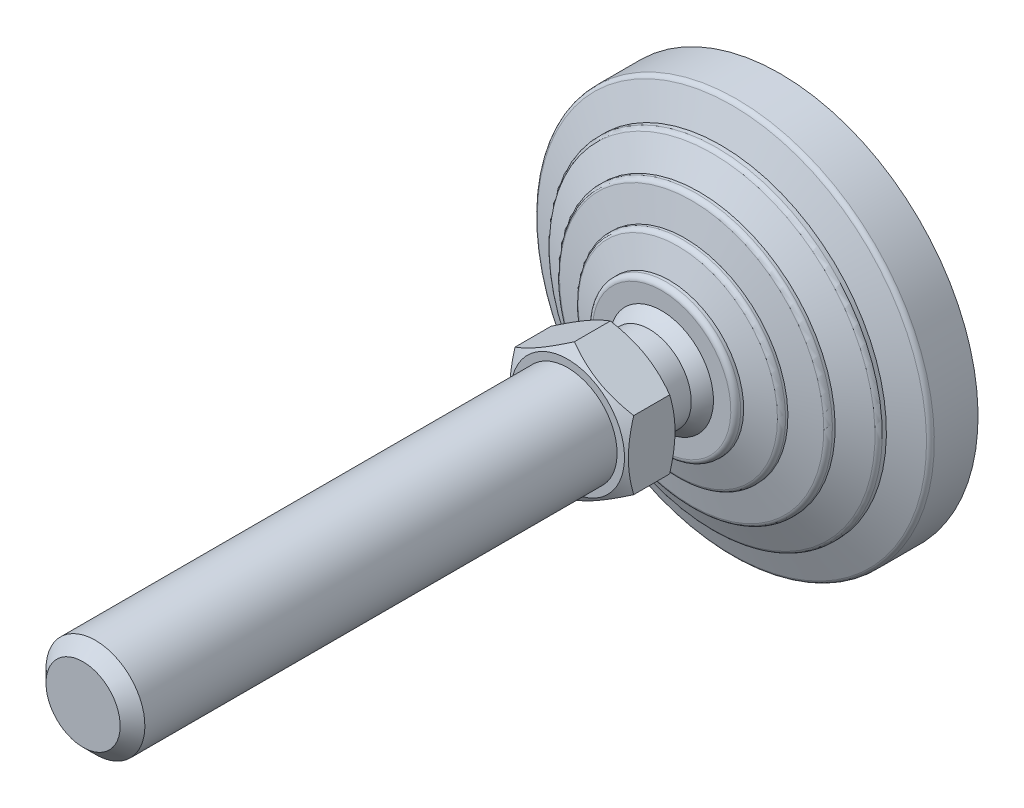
ISO-10303-21;
HEADER;
FILE_DESCRIPTION(('STEP AP214'),'2;1');
FILE_NAME('part.step','',(''),(''),'','','');
FILE_SCHEMA(('AUTOMOTIVE_DESIGN { 1 0 10303 214 1 1 1 1 }'));
ENDSEC;
DATA;
#1=APPLICATION_CONTEXT('core data for automotive mechanical design processes');
#2=APPLICATION_PROTOCOL_DEFINITION('international standard','automotive_design',2000,#1);
#3=PRODUCT_CONTEXT('',#1,'mechanical');
#4=PRODUCT('Part','Part','',(#3));
#5=PRODUCT_RELATED_PRODUCT_CATEGORY('part','',(#4));
#6=PRODUCT_DEFINITION_FORMATION('','',#4);
#7=PRODUCT_DEFINITION_CONTEXT('part definition',#1,'design');
#8=PRODUCT_DEFINITION('design','',#6,#7);
#9=PRODUCT_DEFINITION_SHAPE('','',#8);
#10=(LENGTH_UNIT() NAMED_UNIT(*) SI_UNIT(.MILLI.,.METRE.));
#11=(NAMED_UNIT(*) PLANE_ANGLE_UNIT() SI_UNIT($,.RADIAN.));
#12=(NAMED_UNIT(*) SI_UNIT($,.STERADIAN.) SOLID_ANGLE_UNIT());
#13=UNCERTAINTY_MEASURE_WITH_UNIT(LENGTH_MEASURE(1.E-05),#10,'distance_accuracy_value','');
#14=(GEOMETRIC_REPRESENTATION_CONTEXT(3) GLOBAL_UNCERTAINTY_ASSIGNED_CONTEXT((#13)) GLOBAL_UNIT_ASSIGNED_CONTEXT((#10,
#11,#12)) REPRESENTATION_CONTEXT('',''));
#15=CARTESIAN_POINT('',(0.,0.,0.));
#16=DIRECTION('',(0.,0.,1.));
#17=DIRECTION('',(1.,0.,0.));
#18=AXIS2_PLACEMENT_3D('',#15,#16,#17);
#19=CARTESIAN_POINT('',(-8.49999999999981,0.,32.9999999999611));
#20=DIRECTION('',(0.,0.,1.));
#21=DIRECTION('',(0.,-1.,0.));
#22=AXIS2_PLACEMENT_3D('',#19,#20,#21);
#23=PLANE('',#22);
#24=CARTESIAN_POINT('',(0.,0.,33.000000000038));
#25=DIRECTION('',(0.,0.,-1.));
#26=DIRECTION('',(-1.,0.,0.));
#27=AXIS2_PLACEMENT_3D('',#24,#25,#26);
#28=CIRCLE('',#27,11.5);
#29=CARTESIAN_POINT('',(-11.5,0.,33.000000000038));
#30=VERTEX_POINT('',#29);
#31=EDGE_CURVE('E570',#30,#30,#28,.T.);
#32=ORIENTED_EDGE('',*,*,#31,.T.);
#33=EDGE_LOOP('',(#32));
#34=FACE_BOUND('',#33,.T.);
#35=CARTESIAN_POINT('',(0.,0.,32.9999999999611));
#36=DIRECTION('',(0.,0.,-1.));
#37=DIRECTION('',(0.,1.,0.));
#38=AXIS2_PLACEMENT_3D('',#35,#36,#37);
#39=CIRCLE('',#38,8.49999999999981);
#40=CARTESIAN_POINT('',(0.,8.49999999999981,32.9999999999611));
#41=VERTEX_POINT('',#40);
#42=EDGE_CURVE('E150',#41,#41,#39,.T.);
#43=ORIENTED_EDGE('',*,*,#42,.F.);
#44=EDGE_LOOP('',(#43));
#45=FACE_BOUND('',#44,.T.);
#46=ADVANCED_FACE('F14',(#34,#45),#23,.F.);
#47=CARTESIAN_POINT('',(0.,0.,0.));
#48=DIRECTION('',(0.,0.,-1.));
#49=DIRECTION('',(0.,1.,0.));
#50=AXIS2_PLACEMENT_3D('',#47,#48,#49);
#51=CYLINDRICAL_SURFACE('',#50,8.49999999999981);
#52=CARTESIAN_POINT('',(0.,0.,26.4999999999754));
#53=DIRECTION('',(0.,0.,-1.));
#54=DIRECTION('',(0.,1.,0.));
#55=AXIS2_PLACEMENT_3D('',#52,#53,#54);
#56=CIRCLE('',#55,8.49999999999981);
#57=CARTESIAN_POINT('',(0.,8.49999999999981,26.4999999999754));
#58=VERTEX_POINT('',#57);
#59=EDGE_CURVE('E147',#58,#58,#56,.T.);
#60=ORIENTED_EDGE('',*,*,#59,.F.);
#61=EDGE_LOOP('',(#60));
#62=FACE_BOUND('',#61,.T.);
#63=ORIENTED_EDGE('',*,*,#42,.T.);
#64=EDGE_LOOP('',(#63));
#65=FACE_BOUND('',#64,.T.);
#66=ADVANCED_FACE('F174',(#62,#65),#51,.T.);
#67=CARTESIAN_POINT('',(-8.49107182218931,0.,26.4999999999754));
#68=DIRECTION('',(0.,0.,1.));
#69=DIRECTION('',(0.,-1.,0.));
#70=AXIS2_PLACEMENT_3D('',#67,#68,#69);
#71=PLANE('',#70);
#72=CARTESIAN_POINT('',(0.,0.,26.4999999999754));
#73=DIRECTION('',(0.,0.,-1.));
#74=DIRECTION('',(0.,1.,0.));
#75=AXIS2_PLACEMENT_3D('',#72,#73,#74);
#76=CIRCLE('',#75,8.49107182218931);
#77=CARTESIAN_POINT('',(-8.49107182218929,0.,26.4999999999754));
#78=VERTEX_POINT('',#77);
#79=EDGE_CURVE('E144',#78,#78,#76,.T.);
#80=ORIENTED_EDGE('',*,*,#79,.F.);
#81=EDGE_LOOP('',(#80));
#82=FACE_BOUND('',#81,.T.);
#83=ORIENTED_EDGE('',*,*,#59,.T.);
#84=EDGE_LOOP('',(#83));
#85=FACE_BOUND('',#84,.T.);
#86=ADVANCED_FACE('F181',(#82,#85),#71,.F.);
#87=CARTESIAN_POINT('',(-2.77555756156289E-12,0.,17.6702661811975));
#88=DIRECTION('',(0.,0.,-1.));
#89=DIRECTION('',(-1.,0.,0.));
#90=AXIS2_PLACEMENT_3D('',#87,#88,#89);
#91=SPHERICAL_SURFACE('',#90,12.25);
#92=CARTESIAN_POINT('',(0.,0.,24.));
#93=DIRECTION('',(0.,0.,-1.));
#94=DIRECTION('',(0.,1.,0.));
#95=AXIS2_PLACEMENT_3D('',#92,#93,#94);
#96=CIRCLE('',#95,10.4879440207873);
#97=CARTESIAN_POINT('',(-10.4879440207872,0.,24.));
#98=VERTEX_POINT('',#97);
#99=EDGE_CURVE('E141',#98,#98,#96,.T.);
#100=CARTESIAN_POINT('',(-10.4879440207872,0.,24.));
#101=CARTESIAN_POINT('',(-10.4706730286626,0.,24.0286168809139));
#102=CARTESIAN_POINT('',(-10.4532849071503,0.,24.0571630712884));
#103=CARTESIAN_POINT('',(-10.4182755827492,0.,24.1141121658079));
#104=CARTESIAN_POINT('',(-10.4006543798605,0.,24.1425150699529));
#105=CARTESIAN_POINT('',(-10.3651800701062,0.,24.1991756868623));
#106=CARTESIAN_POINT('',(-10.3473269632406,0.,24.2274333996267));
#107=CARTESIAN_POINT('',(-10.3113900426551,0.,24.283801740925));
#108=CARTESIAN_POINT('',(-10.2933062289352,0.,24.3119123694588));
#109=CARTESIAN_POINT('',(-10.2569091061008,0.,24.367984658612));
#110=CARTESIAN_POINT('',(-10.2385957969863,0.,24.3959463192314));
#111=CARTESIAN_POINT('',(-10.2017409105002,0.,24.4517187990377));
#112=CARTESIAN_POINT('',(-10.1831993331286,0.,24.4795296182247));
#113=CARTESIAN_POINT('',(-10.1458891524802,0.,24.5349985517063));
#114=CARTESIAN_POINT('',(-10.1271205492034,0.,24.5626566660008));
#115=CARTESIAN_POINT('',(-10.0893575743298,0.,24.6178183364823));
#116=CARTESIAN_POINT('',(-10.070363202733,0.,24.6453218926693));
#117=CARTESIAN_POINT('',(-10.0321499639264,0.,24.7001726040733));
#118=CARTESIAN_POINT('',(-10.0129310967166,0.,24.7275197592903));
#119=CARTESIAN_POINT('',(-9.97427015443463,0.,24.7820558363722));
#120=CARTESIAN_POINT('',(-9.95482807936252,0.,24.8092447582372));
#121=CARTESIAN_POINT('',(-9.91572202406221,0.,24.8634625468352));
#122=CARTESIAN_POINT('',(-9.89605804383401,0.,24.8904914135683));
#123=CARTESIAN_POINT('',(-9.85650949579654,0.,24.9443872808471));
#124=CARTESIAN_POINT('',(-9.83662492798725,0.,24.9712542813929));
#125=CARTESIAN_POINT('',(-9.79663653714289,0.,25.0248246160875));
#126=CARTESIAN_POINT('',(-9.77653271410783,0.,25.0515279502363));
#127=CARTESIAN_POINT('',(-9.73610715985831,0.,25.1047691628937));
#128=CARTESIAN_POINT('',(-9.71578542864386,0.,25.1313070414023));
#129=CARTESIAN_POINT('',(-9.67492541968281,0.,25.1842155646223));
#130=CARTESIAN_POINT('',(-9.65438714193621,0.,25.2105862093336));
#131=CARTESIAN_POINT('',(-9.61309541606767,0.,25.2631584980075));
#132=CARTESIAN_POINT('',(-9.59234196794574,0.,25.28936014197));
#133=CARTESIAN_POINT('',(-9.55062129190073,0.,25.3415926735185));
#134=CARTESIAN_POINT('',(-9.52965406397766,0.,25.3676235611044));
#135=CARTESIAN_POINT('',(-9.48750723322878,0.,25.4195128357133));
#136=CARTESIAN_POINT('',(-9.46632763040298,0.,25.4453712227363));
#137=CARTESIAN_POINT('',(-9.42375746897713,0.,25.4969137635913));
#138=CARTESIAN_POINT('',(-9.40236691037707,0.,25.5225979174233));
#139=CARTESIAN_POINT('',(-9.35937627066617,0.,25.5737902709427));
#140=CARTESIAN_POINT('',(-9.33777618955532,0.,25.5992984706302));
#141=CARTESIAN_POINT('',(-9.29436795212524,0.,25.6501372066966));
#142=CARTESIAN_POINT('',(-9.27255979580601,0.,25.6754677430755));
#143=CARTESIAN_POINT('',(-9.22873686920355,0.,25.7259494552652));
#144=CARTESIAN_POINT('',(-9.20672209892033,0.,25.751100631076));
#145=CARTESIAN_POINT('',(-9.16248741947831,0.,25.8012219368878));
#146=CARTESIAN_POINT('',(-9.14026751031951,0.,25.8261920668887));
#147=CARTESIAN_POINT('',(-9.0956240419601,0.,25.87594960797));
#148=CARTESIAN_POINT('',(-9.07320048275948,0.,25.9007370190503));
#149=CARTESIAN_POINT('',(-9.0281512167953,0.,25.9501274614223));
#150=CARTESIAN_POINT('',(-9.00552551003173,0.,25.9747304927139));
#151=CARTESIAN_POINT('',(-8.96007346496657,0.,26.023750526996));
#152=CARTESIAN_POINT('',(-8.93724712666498,0.,26.0481675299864));
#153=CARTESIAN_POINT('',(-8.8913953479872,0.,26.0968138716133));
#154=CARTESIAN_POINT('',(-8.868369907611,0.,26.1210432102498));
#155=CARTESIAN_POINT('',(-8.82212146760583,0.,26.1693125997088));
#156=CARTESIAN_POINT('',(-8.79889846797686,0.,26.1933526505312));
#157=CARTESIAN_POINT('',(-8.75225646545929,0.,26.2412418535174));
#158=CARTESIAN_POINT('',(-8.72883746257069,0.,26.2650910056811));
#159=CARTESIAN_POINT('',(-8.68180502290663,0.,26.3125968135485));
#160=CARTESIAN_POINT('',(-8.65819158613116,0.,26.3362534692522));
#161=CARTESIAN_POINT('',(-8.61077186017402,0.,26.383372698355));
#162=CARTESIAN_POINT('',(-8.58696557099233,0.,26.4068352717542));
#163=CARTESIAN_POINT('',(-8.53916173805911,0.,26.4535647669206));
#164=CARTESIAN_POINT('',(-8.51516419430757,0.,26.4768316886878));
#165=CARTESIAN_POINT('',(-8.49107182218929,0.,26.4999999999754));
#166=B_SPLINE_CURVE_WITH_KNOTS('',3,(#100,#101,#102,#103,#104,#105,#106,#107,#108,#109,#110,
#111,#112,#113,#114,#115,#116,#117,#118,#119,#120,#121,#122,#123,#124,#125,#126,#127,#128,#129,
#130,#131,#132,#133,#134,#135,#136,#137,#138,#139,#140,#141,#142,#143,#144,#145,#146,#147,#148,
#149,#150,#151,#152,#153,#154,#155,#156,#157,#158,#159,#160,#161,#162,#163,#164,#165),
.UNSPECIFIED.,.F.,.F.,(4,2,2,2,2,2,2,2,2,2,2,2,2,2,2,2,2,2,2,2,2,2,2,2,2,2,2,2,2,2,2,2,4),(0.,
0.100273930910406,0.20054786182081,0.30082179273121,0.401095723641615,0.501369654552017,
0.601643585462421,0.701917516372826,0.802191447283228,0.90246537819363,1.00273930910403,
1.10301324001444,1.20328717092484,1.30356110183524,1.40383503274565,1.50410896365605,
1.60438289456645,1.70465682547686,1.80493075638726,1.90520468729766,2.00547861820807,
2.10575254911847,2.20602648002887,2.30630041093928,2.40657434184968,2.50684827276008,
2.60712220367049,2.70739613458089,2.80767006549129,2.90794399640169,3.0082179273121,
3.1084918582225,3.2087657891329),.UNSPECIFIED.);
#167=EDGE_CURVE('BSEAM433',#98,#78,#166,.T.);
#168=ORIENTED_EDGE('',*,*,#99,.F.);
#169=ORIENTED_EDGE('',*,*,#79,.T.);
#170=ORIENTED_EDGE('',*,*,#167,.T.);
#171=ORIENTED_EDGE('',*,*,#167,.F.);
#172=EDGE_LOOP('',(#168,#170,#169,#171));
#173=FACE_BOUND('',#172,.T.);
#174=ADVANCED_FACE('F433',(#173),#91,.T.);
#175=CARTESIAN_POINT('',(-10.4879440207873,0.,24.));
#176=DIRECTION('',(0.,0.,-1.));
#177=DIRECTION('',(0.,1.,0.));
#178=AXIS2_PLACEMENT_3D('',#175,#176,#177);
#179=PLANE('',#178);
#180=CARTESIAN_POINT('',(0.,0.,24.));
#181=DIRECTION('',(0.,0.,-1.));
#182=DIRECTION('',(0.,1.,0.));
#183=AXIS2_PLACEMENT_3D('',#180,#181,#182);
#184=CIRCLE('',#183,13.9999999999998);
#185=CARTESIAN_POINT('',(0.,13.9999999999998,24.));
#186=VERTEX_POINT('',#185);
#187=EDGE_CURVE('E138',#186,#186,#184,.T.);
#188=ORIENTED_EDGE('',*,*,#187,.F.);
#189=EDGE_LOOP('',(#188));
#190=FACE_BOUND('',#189,.T.);
#191=ORIENTED_EDGE('',*,*,#99,.T.);
#192=EDGE_LOOP('',(#191));
#193=FACE_BOUND('',#192,.T.);
#194=ADVANCED_FACE('F423',(#190,#193),#179,.F.);
#195=CARTESIAN_POINT('',(0.,0.,23.));
#196=DIRECTION('',(0.,0.,-1.));
#197=DIRECTION('',(0.,1.,0.));
#198=AXIS2_PLACEMENT_3D('',#195,#196,#197);
#199=TOROIDAL_SURFACE('',#198,13.9999999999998,1.);
#200=CARTESIAN_POINT('',(0.,0.,23.));
#201=DIRECTION('',(0.,0.,-1.));
#202=DIRECTION('',(0.,1.,0.));
#203=AXIS2_PLACEMENT_3D('',#200,#201,#202);
#204=CIRCLE('',#203,14.9999999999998);
#205=CARTESIAN_POINT('',(0.,14.9999999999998,23.));
#206=VERTEX_POINT('',#205);
#207=EDGE_CURVE('E135',#206,#206,#204,.T.);
#208=ORIENTED_EDGE('',*,*,#207,.F.);
#209=EDGE_LOOP('',(#208));
#210=FACE_BOUND('',#209,.T.);
#211=ORIENTED_EDGE('',*,*,#187,.T.);
#212=EDGE_LOOP('',(#211));
#213=FACE_BOUND('',#212,.T.);
#214=ADVANCED_FACE('F413',(#210,#213),#199,.T.);
#215=CARTESIAN_POINT('',(0.,0.,0.));
#216=DIRECTION('',(0.,0.,-1.));
#217=DIRECTION('',(0.,1.,0.));
#218=AXIS2_PLACEMENT_3D('',#215,#216,#217);
#219=CYLINDRICAL_SURFACE('',#218,14.9999999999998);
#220=CARTESIAN_POINT('',(0.,0.,22.4025287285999));
#221=DIRECTION('',(0.,0.,-1.));
#222=DIRECTION('',(0.,1.,0.));
#223=AXIS2_PLACEMENT_3D('',#220,#221,#222);
#224=CIRCLE('',#223,14.9999999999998);
#225=CARTESIAN_POINT('',(0.,14.9999999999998,22.4025287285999));
#226=VERTEX_POINT('',#225);
#227=EDGE_CURVE('E132',#226,#226,#224,.T.);
#228=ORIENTED_EDGE('',*,*,#227,.F.);
#229=EDGE_LOOP('',(#228));
#230=FACE_BOUND('',#229,.T.);
#231=ORIENTED_EDGE('',*,*,#207,.T.);
#232=EDGE_LOOP('',(#231));
#233=FACE_BOUND('',#232,.T.);
#234=ADVANCED_FACE('F403',(#230,#233),#219,.T.);
#235=CARTESIAN_POINT('',(0.,0.,22.4025287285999));
#236=DIRECTION('',(0.,0.,-1.));
#237=DIRECTION('',(0.,1.,0.));
#238=AXIS2_PLACEMENT_3D('',#235,#236,#237);
#239=CONICAL_SURFACE('',#238,14.9999999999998,1.25589726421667);
#240=CARTESIAN_POINT('',(0.,0.,20.7216684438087));
#241=DIRECTION('',(0.,0.,-1.));
#242=DIRECTION('',(0.,1.,0.));
#243=AXIS2_PLACEMENT_3D('',#240,#241,#242);
#244=CIRCLE('',#243,20.1601635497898);
#245=CARTESIAN_POINT('',(0.,20.1601635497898,20.7216684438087));
#246=VERTEX_POINT('',#245);
#247=EDGE_CURVE('E129',#246,#246,#244,.T.);
#248=ORIENTED_EDGE('',*,*,#247,.F.);
#249=EDGE_LOOP('',(#248));
#250=FACE_BOUND('',#249,.T.);
#251=ORIENTED_EDGE('',*,*,#227,.T.);
#252=EDGE_LOOP('',(#251));
#253=FACE_BOUND('',#252,.T.);
#254=ADVANCED_FACE('F393',(#250,#253),#239,.T.);
#255=CARTESIAN_POINT('',(0.,0.,19.7708407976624));
#256=DIRECTION('',(0.,0.,-1.));
#257=DIRECTION('',(0.,1.,0.));
#258=AXIS2_PLACEMENT_3D('',#255,#256,#257);
#259=TOROIDAL_SURFACE('',#258,19.8504430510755,1.);
#260=CARTESIAN_POINT('',(0.,0.,19.7708407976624));
#261=DIRECTION('',(0.,0.,-1.));
#262=DIRECTION('',(0.,1.,0.));
#263=AXIS2_PLACEMENT_3D('',#260,#261,#262);
#264=CIRCLE('',#263,20.8504430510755);
#265=CARTESIAN_POINT('',(0.,20.8504430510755,19.7708407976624));
#266=VERTEX_POINT('',#265);
#267=EDGE_CURVE('E126',#266,#266,#264,.T.);
#268=ORIENTED_EDGE('',*,*,#267,.F.);
#269=EDGE_LOOP('',(#268));
#270=FACE_BOUND('',#269,.T.);
#271=ORIENTED_EDGE('',*,*,#247,.T.);
#272=EDGE_LOOP('',(#271));
#273=FACE_BOUND('',#272,.T.);
#274=ADVANCED_FACE('F383',(#270,#273),#259,.T.);
#275=CARTESIAN_POINT('',(0.,0.,0.));
#276=DIRECTION('',(0.,0.,-1.));
#277=DIRECTION('',(0.,1.,0.));
#278=AXIS2_PLACEMENT_3D('',#275,#276,#277);
#279=CYLINDRICAL_SURFACE('',#278,20.8504430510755);
#280=CARTESIAN_POINT('',(0.,0.,19.2987385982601));
#281=DIRECTION('',(0.,0.,-1.));
#282=DIRECTION('',(0.,1.,0.));
#283=AXIS2_PLACEMENT_3D('',#280,#281,#282);
#284=CIRCLE('',#283,20.8504430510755);
#285=CARTESIAN_POINT('',(0.,20.8504430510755,19.2987385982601));
#286=VERTEX_POINT('',#285);
#287=EDGE_CURVE('E123',#286,#286,#284,.T.);
#288=ORIENTED_EDGE('',*,*,#287,.F.);
#289=EDGE_LOOP('',(#288));
#290=FACE_BOUND('',#289,.T.);
#291=ORIENTED_EDGE('',*,*,#267,.T.);
#292=EDGE_LOOP('',(#291));
#293=FACE_BOUND('',#292,.T.);
#294=ADVANCED_FACE('F373',(#290,#293),#279,.T.);
#295=CARTESIAN_POINT('',(0.,0.,19.2987385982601));
#296=DIRECTION('',(0.,0.,-1.));
#297=DIRECTION('',(0.,1.,0.));
#298=AXIS2_PLACEMENT_3D('',#295,#296,#297);
#299=CONICAL_SURFACE('',#298,20.8504430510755,1.34067144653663);
#300=CARTESIAN_POINT('',(0.,0.,17.9217501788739));
#301=DIRECTION('',(0.,0.,-1.));
#302=DIRECTION('',(0.,1.,0.));
#303=AXIS2_PLACEMENT_3D('',#300,#301,#302);
#304=CIRCLE('',#303,26.7280991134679);
#305=CARTESIAN_POINT('',(0.,26.7280991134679,17.9217501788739));
#306=VERTEX_POINT('',#305);
#307=EDGE_CURVE('E120',#306,#306,#304,.T.);
#308=ORIENTED_EDGE('',*,*,#307,.F.);
#309=EDGE_LOOP('',(#308));
#310=FACE_BOUND('',#309,.T.);
#311=ORIENTED_EDGE('',*,*,#287,.T.);
#312=EDGE_LOOP('',(#311));
#313=FACE_BOUND('',#312,.T.);
#314=ADVANCED_FACE('F363',(#310,#313),#299,.T.);
#315=CARTESIAN_POINT('',(0.,0.,16.9481122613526));
#316=DIRECTION('',(0.,0.,-1.));
#317=DIRECTION('',(0.,1.,0.));
#318=AXIS2_PLACEMENT_3D('',#315,#316,#317);
#319=TOROIDAL_SURFACE('',#318,26.5,1.00000000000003);
#320=CARTESIAN_POINT('',(0.,0.,16.9481122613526));
#321=DIRECTION('',(0.,0.,-1.));
#322=DIRECTION('',(0.,1.,0.));
#323=AXIS2_PLACEMENT_3D('',#320,#321,#322);
#324=CIRCLE('',#323,27.5);
#325=CARTESIAN_POINT('',(0.,27.5,16.9481122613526));
#326=VERTEX_POINT('',#325);
#327=EDGE_CURVE('E117',#326,#326,#324,.T.);
#328=ORIENTED_EDGE('',*,*,#327,.F.);
#329=EDGE_LOOP('',(#328));
#330=FACE_BOUND('',#329,.T.);
#331=ORIENTED_EDGE('',*,*,#307,.T.);
#332=EDGE_LOOP('',(#331));
#333=FACE_BOUND('',#332,.T.);
#334=ADVANCED_FACE('F353',(#330,#333),#319,.T.);
#335=CARTESIAN_POINT('',(0.,0.,0.));
#336=DIRECTION('',(0.,0.,-1.));
#337=DIRECTION('',(0.,1.,0.));
#338=AXIS2_PLACEMENT_3D('',#335,#336,#337);
#339=CYLINDRICAL_SURFACE('',#338,27.5);
#340=CARTESIAN_POINT('',(0.,0.,16.4025287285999));
#341=DIRECTION('',(0.,0.,-1.));
#342=DIRECTION('',(0.,1.,0.));
#343=AXIS2_PLACEMENT_3D('',#340,#341,#342);
#344=CIRCLE('',#343,27.5);
#345=CARTESIAN_POINT('',(0.,27.5,16.4025287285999));
#346=VERTEX_POINT('',#345);
#347=EDGE_CURVE('E114',#346,#346,#344,.T.);
#348=ORIENTED_EDGE('',*,*,#347,.F.);
#349=EDGE_LOOP('',(#348));
#350=FACE_BOUND('',#349,.T.);
#351=ORIENTED_EDGE('',*,*,#327,.T.);
#352=EDGE_LOOP('',(#351));
#353=FACE_BOUND('',#352,.T.);
#354=ADVANCED_FACE('F343',(#350,#353),#339,.T.);
#355=CARTESIAN_POINT('',(0.,0.,16.4025287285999));
#356=DIRECTION('',(0.,0.,-1.));
#357=DIRECTION('',(0.,1.,0.));
#358=AXIS2_PLACEMENT_3D('',#355,#356,#357);
#359=CONICAL_SURFACE('',#358,27.5,1.1202291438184);
#360=CARTESIAN_POINT('',(0.,0.,13.7730910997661));
#361=DIRECTION('',(0.,0.,-1.));
#362=DIRECTION('',(0.,1.,0.));
#363=AXIS2_PLACEMENT_3D('',#360,#361,#362);
#364=CIRCLE('',#363,32.935476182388);
#365=CARTESIAN_POINT('',(0.,32.935476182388,13.7730910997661));
#366=VERTEX_POINT('',#365);
#367=EDGE_CURVE('E111',#366,#366,#364,.T.);
#368=ORIENTED_EDGE('',*,*,#367,.F.);
#369=EDGE_LOOP('',(#368));
#370=FACE_BOUND('',#369,.T.);
#371=ORIENTED_EDGE('',*,*,#347,.T.);
#372=EDGE_LOOP('',(#371));
#373=FACE_BOUND('',#372,.T.);
#374=ADVANCED_FACE('F333',(#370,#373),#359,.T.);
#375=CARTESIAN_POINT('',(0.,0.,12.8728908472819));
#376=DIRECTION('',(0.,0.,-1.));
#377=DIRECTION('',(0.,1.,0.));
#378=AXIS2_PLACEMENT_3D('',#375,#376,#377);
#379=TOROIDAL_SURFACE('',#378,32.5,0.999999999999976);
#380=CARTESIAN_POINT('',(0.,0.,12.8728908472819));
#381=DIRECTION('',(0.,0.,-1.));
#382=DIRECTION('',(0.,1.,0.));
#383=AXIS2_PLACEMENT_3D('',#380,#381,#382);
#384=CIRCLE('',#383,33.5);
#385=CARTESIAN_POINT('',(0.,33.5,12.8728908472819));
#386=VERTEX_POINT('',#385);
#387=EDGE_CURVE('E108',#386,#386,#384,.T.);
#388=ORIENTED_EDGE('',*,*,#387,.F.);
#389=EDGE_LOOP('',(#388));
#390=FACE_BOUND('',#389,.T.);
#391=ORIENTED_EDGE('',*,*,#367,.T.);
#392=EDGE_LOOP('',(#391));
#393=FACE_BOUND('',#392,.T.);
#394=ADVANCED_FACE('F323',(#390,#393),#379,.T.);
#395=CARTESIAN_POINT('',(0.,0.,0.));
#396=DIRECTION('',(0.,0.,-1.));
#397=DIRECTION('',(0.,1.,0.));
#398=AXIS2_PLACEMENT_3D('',#395,#396,#397);
#399=CYLINDRICAL_SURFACE('',#398,33.5);
#400=CARTESIAN_POINT('',(0.,0.,12.0315037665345));
#401=DIRECTION('',(0.,0.,-1.));
#402=DIRECTION('',(0.,1.,0.));
#403=AXIS2_PLACEMENT_3D('',#400,#401,#402);
#404=CIRCLE('',#403,33.5);
#405=CARTESIAN_POINT('',(0.,33.5,12.0315037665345));
#406=VERTEX_POINT('',#405);
#407=EDGE_CURVE('E105',#406,#406,#404,.T.);
#408=ORIENTED_EDGE('',*,*,#407,.F.);
#409=EDGE_LOOP('',(#408));
#410=FACE_BOUND('',#409,.T.);
#411=ORIENTED_EDGE('',*,*,#387,.T.);
#412=EDGE_LOOP('',(#411));
#413=FACE_BOUND('',#412,.T.);
#414=ADVANCED_FACE('F313',(#410,#413),#399,.T.);
#415=CARTESIAN_POINT('',(0.,0.,12.0315037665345));
#416=DIRECTION('',(0.,0.,-1.));
#417=DIRECTION('',(0.,1.,0.));
#418=AXIS2_PLACEMENT_3D('',#415,#416,#417);
#419=CONICAL_SURFACE('',#418,33.5,1.20362249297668);
#420=CARTESIAN_POINT('',(0.,0.,9.77805027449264));
#421=DIRECTION('',(0.,0.,-1.));
#422=DIRECTION('',(0.,1.,0.));
#423=AXIS2_PLACEMENT_3D('',#420,#421,#422);
#424=CIRCLE('',#423,39.3589790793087);
#425=CARTESIAN_POINT('',(0.,39.3589790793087,9.77805027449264));
#426=VERTEX_POINT('',#425);
#427=EDGE_CURVE('E102',#426,#426,#424,.T.);
#428=ORIENTED_EDGE('',*,*,#427,.F.);
#429=EDGE_LOOP('',(#428));
#430=FACE_BOUND('',#429,.T.);
#431=ORIENTED_EDGE('',*,*,#407,.T.);
#432=EDGE_LOOP('',(#431));
#433=FACE_BOUND('',#432,.T.);
#434=ADVANCED_FACE('F303',(#430,#433),#419,.T.);
#435=CARTESIAN_POINT('',(0.,0.,8.84470466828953));
#436=DIRECTION('',(0.,0.,-1.));
#437=DIRECTION('',(0.,1.,0.));
#438=AXIS2_PLACEMENT_3D('',#435,#436,#437);
#439=TOROIDAL_SURFACE('',#438,39.,1.00000000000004);
#440=CARTESIAN_POINT('',(0.,0.,8.84470466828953));
#441=DIRECTION('',(0.,0.,-1.));
#442=DIRECTION('',(0.,1.,0.));
#443=AXIS2_PLACEMENT_3D('',#440,#441,#442);
#444=CIRCLE('',#443,40.);
#445=CARTESIAN_POINT('',(0.,40.,8.84470466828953));
#446=VERTEX_POINT('',#445);
#447=EDGE_CURVE('E99',#446,#446,#444,.T.);
#448=ORIENTED_EDGE('',*,*,#447,.F.);
#449=EDGE_LOOP('',(#448));
#450=FACE_BOUND('',#449,.T.);
#451=ORIENTED_EDGE('',*,*,#427,.T.);
#452=EDGE_LOOP('',(#451));
#453=FACE_BOUND('',#452,.T.);
#454=ADVANCED_FACE('F293',(#450,#453),#439,.T.);
#455=CARTESIAN_POINT('',(0.,0.,0.));
#456=DIRECTION('',(0.,0.,-1.));
#457=DIRECTION('',(0.,1.,0.));
#458=AXIS2_PLACEMENT_3D('',#455,#456,#457);
#459=CYLINDRICAL_SURFACE('',#458,40.);
#460=CARTESIAN_POINT('',(0.,0.,0.));
#461=DIRECTION('',(0.,0.,-1.));
#462=DIRECTION('',(0.,1.,0.));
#463=AXIS2_PLACEMENT_3D('',#460,#461,#462);
#464=CIRCLE('',#463,40.);
#465=CARTESIAN_POINT('',(0.,40.,0.));
#466=VERTEX_POINT('',#465);
#467=EDGE_CURVE('E96',#466,#466,#464,.T.);
#468=ORIENTED_EDGE('',*,*,#467,.F.);
#469=EDGE_LOOP('',(#468));
#470=FACE_BOUND('',#469,.T.);
#471=ORIENTED_EDGE('',*,*,#447,.T.);
#472=EDGE_LOOP('',(#471));
#473=FACE_BOUND('',#472,.T.);
#474=ADVANCED_FACE('F282',(#470,#473),#459,.T.);
#475=CARTESIAN_POINT('',(0.,0.,0.));
#476=DIRECTION('',(0.,0.,1.));
#477=DIRECTION('',(0.,-1.,0.));
#478=AXIS2_PLACEMENT_3D('',#475,#476,#477);
#479=PLANE('',#478);
#480=ORIENTED_EDGE('',*,*,#467,.T.);
#481=EDGE_LOOP('',(#480));
#482=FACE_BOUND('',#481,.T.);
#483=ADVANCED_FACE('F172',(#482),#479,.F.);
#484=CARTESIAN_POINT('',(0.,0.,35.5708904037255));
#485=DIRECTION('',(0.,0.,1.));
#486=DIRECTION('',(1.,0.,0.));
#487=AXIS2_PLACEMENT_3D('',#484,#485,#486);
#488=CONICAL_SURFACE('',#487,15.9529127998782,1.0471975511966);
#489=CARTESIAN_POINT('',(0.000200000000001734,-13.8565219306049,34.3605385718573));
#490=CARTESIAN_POINT('',(-0.263585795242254,-13.7042251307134,34.2726247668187));
#491=CARTESIAN_POINT('',(-0.52835511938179,-13.5513604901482,34.1887011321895));
#492=CARTESIAN_POINT('',(-1.06001701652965,-13.2444053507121,34.0299413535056));
#493=CARTESIAN_POINT('',(-1.32691025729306,-13.0903144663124,33.9551081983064));
#494=CARTESIAN_POINT('',(-2.131890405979,-12.6255589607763,33.7456926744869));
#495=CARTESIAN_POINT('',(-2.67315507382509,-12.3130596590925,33.6265783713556));
#496=CARTESIAN_POINT('',(-3.48313282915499,-11.8454187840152,33.4869061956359));
#497=CARTESIAN_POINT('',(-3.74942610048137,-11.6916742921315,33.4471189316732));
#498=CARTESIAN_POINT('',(-4.28324559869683,-11.3834734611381,33.3803985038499));
#499=CARTESIAN_POINT('',(-4.55077184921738,-11.2290171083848,33.3534655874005));
#500=CARTESIAN_POINT('',(-5.08627036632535,-10.9198468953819,33.3131437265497));
#501=CARTESIAN_POINT('',(-5.35424172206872,-10.7651335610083,33.2997386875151));
#502=CARTESIAN_POINT('',(-5.89043273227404,-10.4555635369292,33.28675822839));
#503=CARTESIAN_POINT('',(-6.15865237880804,-10.3007068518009,33.2871823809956));
#504=CARTESIAN_POINT('',(-6.66008937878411,-10.0112020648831,33.3008951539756));
#505=CARTESIAN_POINT('',(-6.89334249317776,-9.87653331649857,33.3125111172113));
#506=CARTESIAN_POINT('',(-7.35931224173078,-9.60750555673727,33.3459831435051));
#507=CARTESIAN_POINT('',(-7.59202883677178,-9.47314656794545,33.367839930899));
#508=CARTESIAN_POINT('',(-8.05679907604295,-9.20481134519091,33.4214125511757));
#509=CARTESIAN_POINT('',(-8.28885201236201,-9.07083551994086,33.4531365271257));
#510=CARTESIAN_POINT('',(-8.75186996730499,-8.8035119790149,33.5258869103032));
#511=CARTESIAN_POINT('',(-8.98283491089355,-8.67016430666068,33.566913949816));
#512=CARTESIAN_POINT('',(-9.68394195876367,-8.26537996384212,33.7049867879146));
#513=CARTESIAN_POINT('',(-10.1520537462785,-7.99511549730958,33.8158000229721));
#514=CARTESIAN_POINT('',(-11.0812971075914,-7.45861659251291,34.0673009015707));
#515=CARTESIAN_POINT('',(-11.5424405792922,-7.19237528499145,34.2079294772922));
#516=CARTESIAN_POINT('',(-12.0002,-6.92808776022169,34.3605385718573));
#517=B_SPLINE_CURVE_WITH_KNOTS('',3,(#489,#490,#491,#492,#493,#494,#495,#496,#497,#498,#499,
#500,#501,#502,#503,#504,#505,#506,#507,#508,#509,#510,#511,#512,#513,#514,#515,#516),
.UNSPECIFIED.,.F.,.F.,(4,2,2,2,2,2,2,2,2,2,2,2,2,4),(0.,0.951004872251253,1.90232158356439,
3.8090046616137,4.73894551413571,5.66890426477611,6.59775529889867,7.52657763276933,
8.33514643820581,9.14377244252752,9.95306755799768,10.7624176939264,12.4167102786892,
14.0677556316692),.UNSPECIFIED.);
#518=CARTESIAN_POINT('',(0.,-13.856406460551,34.3604719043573));
#519=VERTEX_POINT('',#518);
#520=CARTESIAN_POINT('',(-12.,-6.92820323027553,34.3604719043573));
#521=VERTEX_POINT('',#520);
#522=EDGE_CURVE('E73',#519,#521,#517,.T.);
#523=ORIENTED_EDGE('',*,*,#522,.T.);
#524=CARTESIAN_POINT('',(-12.,-18.5027719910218,39.0930098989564));
#525=CARTESIAN_POINT('',(-12.,-18.2411644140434,38.9662907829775));
#526=CARTESIAN_POINT('',(-12.,-17.9792469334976,38.8402117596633));
#527=CARTESIAN_POINT('',(-12.,-17.4547274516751,38.5894790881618));
#528=CARTESIAN_POINT('',(-12.,-17.1921254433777,38.4648254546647));
#529=CARTESIAN_POINT('',(-12.,-16.4031241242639,38.0931868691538));
#530=CARTESIAN_POINT('',(-12.,-15.8756085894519,37.8485626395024));
#531=CARTESIAN_POINT('',(-12.,-14.8140887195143,37.3657692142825));
#532=CARTESIAN_POINT('',(-12.,-14.280064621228,37.1276433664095));
#533=CARTESIAN_POINT('',(-12.,-13.2077317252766,36.6612773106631));
#534=CARTESIAN_POINT('',(-12.,-12.6694231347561,36.4330366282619));
#535=CARTESIAN_POINT('',(-12.,-11.5707184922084,35.9821052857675));
#536=CARTESIAN_POINT('',(-12.,-11.0101584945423,35.7598119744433));
#537=CARTESIAN_POINT('',(-12.,-9.88243682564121,35.332309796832));
#538=CARTESIAN_POINT('',(-12.,-9.31527441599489,35.1271028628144));
#539=CARTESIAN_POINT('',(-12.,-8.17456107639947,34.7392421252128));
#540=CARTESIAN_POINT('',(-12.,-7.60102612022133,34.5565417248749));
#541=CARTESIAN_POINT('',(-12.,-6.4456755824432,34.2196175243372));
#542=CARTESIAN_POINT('',(-12.,-5.86386270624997,34.065384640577));
#543=CARTESIAN_POINT('',(-12.,-4.98644245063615,33.8614385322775));
#544=CARTESIAN_POINT('',(-12.,-4.69396922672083,33.7981558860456));
#545=CARTESIAN_POINT('',(-12.,-4.10704476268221,33.6814898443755));
#546=CARTESIAN_POINT('',(-12.,-3.81259356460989,33.6281062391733));
#547=CARTESIAN_POINT('',(-12.,-3.22192352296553,33.5321869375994));
#548=CARTESIAN_POINT('',(-12.,-2.92570469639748,33.4896511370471));
#549=CARTESIAN_POINT('',(-12.,-2.33182264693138,33.4162799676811));
#550=CARTESIAN_POINT('',(-12.,-2.03415947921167,33.3854441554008));
#551=CARTESIAN_POINT('',(-12.,-1.4416439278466,33.3364662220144));
#552=CARTESIAN_POINT('',(-12.,-1.1468047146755,33.3181657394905));
#553=CARTESIAN_POINT('',(-12.,-0.556617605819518,33.2940420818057));
#554=CARTESIAN_POINT('',(-12.,-0.261269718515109,33.288218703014));
#555=CARTESIAN_POINT('',(-12.,0.329409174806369,33.289187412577));
#556=CARTESIAN_POINT('',(-12.,0.624740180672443,33.2959796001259));
#557=CARTESIAN_POINT('',(-12.,1.21485643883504,33.3220156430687));
#558=CARTESIAN_POINT('',(-12.,1.50964166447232,33.3412600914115));
#559=CARTESIAN_POINT('',(-12.,2.22137710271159,33.4023530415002));
#560=CARTESIAN_POINT('',(-12.,2.63781352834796,33.4502913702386));
#561=CARTESIAN_POINT('',(-12.,3.46752709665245,33.5683816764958));
#562=CARTESIAN_POINT('',(-12.,3.88080378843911,33.6385367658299));
#563=CARTESIAN_POINT('',(-12.,4.70382732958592,33.798564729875));
#564=CARTESIAN_POINT('',(-12.,5.11357109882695,33.8884532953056));
#565=CARTESIAN_POINT('',(-12.,5.92891514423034,34.0852116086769));
#566=CARTESIAN_POINT('',(-12.,6.33451548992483,34.1920810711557));
#567=CARTESIAN_POINT('',(-12.,7.15043808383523,34.422718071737));
#568=CARTESIAN_POINT('',(-12.,7.56066972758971,34.5468039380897));
#569=CARTESIAN_POINT('',(-12.,8.377090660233,34.8075621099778));
#570=CARTESIAN_POINT('',(-12.,8.78327992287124,34.9442344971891));
#571=CARTESIAN_POINT('',(-12.,9.59182103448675,35.2280161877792));
#572=CARTESIAN_POINT('',(-12.,9.99417416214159,35.3751218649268));
#573=CARTESIAN_POINT('',(-12.,10.7955620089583,35.6780624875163));
#574=CARTESIAN_POINT('',(-12.,11.1945967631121,35.8338973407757));
#575=CARTESIAN_POINT('',(-12.,12.1202288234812,36.205191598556));
#576=CARTESIAN_POINT('',(-12.,12.6457082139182,36.4234334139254));
#577=CARTESIAN_POINT('',(-12.,13.6923392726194,36.870087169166));
#578=CARTESIAN_POINT('',(-12.,14.2134906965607,37.0984996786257));
#579=CARTESIAN_POINT('',(-12.,15.2522514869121,37.5635012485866));
#580=CARTESIAN_POINT('',(-12.,15.7698601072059,37.8000919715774));
#581=CARTESIAN_POINT('',(-12.,16.8020072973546,38.2798368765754));
#582=CARTESIAN_POINT('',(-12.,17.3165459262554,38.522990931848));
#583=CARTESIAN_POINT('',(-12.,18.3435775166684,39.0149121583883));
#584=CARTESIAN_POINT('',(-12.,18.8560678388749,39.2636848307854));
#585=CARTESIAN_POINT('',(-12.,19.8788743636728,39.7656590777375));
#586=CARTESIAN_POINT('',(-12.,20.3891905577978,40.0188606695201));
#587=CARTESIAN_POINT('',(-12.,21.4079163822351,40.5289176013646));
#588=CARTESIAN_POINT('',(-12.,21.9163262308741,40.7857725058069));
#589=CARTESIAN_POINT('',(-12.,22.9315705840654,41.3025786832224));
#590=CARTESIAN_POINT('',(-12.,23.4384050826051,41.5625299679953));
#591=CARTESIAN_POINT('',(-12.,24.8746938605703,42.3038732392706));
#592=CARTESIAN_POINT('',(-12.,25.8025474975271,42.7883663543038));
#593=CARTESIAN_POINT('',(-12.,27.6548023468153,43.7639645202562));
#594=CARTESIAN_POINT('',(-12.,28.5792034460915,44.2550697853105));
#595=CARTESIAN_POINT('',(-12.,30.4231183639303,45.2412007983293));
#596=CARTESIAN_POINT('',(-12.,31.3426385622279,45.7362146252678));
#597=CARTESIAN_POINT('',(-12.,32.720282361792,46.4816993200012));
#598=CARTESIAN_POINT('',(-12.,33.1792125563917,46.7306818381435));
#599=CARTESIAN_POINT('',(-12.,34.0965881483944,47.2295367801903));
#600=CARTESIAN_POINT('',(-12.,34.5550335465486,47.4794092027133));
#601=CARTESIAN_POINT('',(-12.,35.013263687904,47.7296758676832));
#602=B_SPLINE_CURVE_WITH_KNOTS('',3,(#524,#525,#526,#527,#528,#529,#530,#531,#532,#533,#534,
#535,#536,#537,#538,#539,#540,#541,#542,#543,#544,#545,#546,#547,#548,#549,#550,#551,#552,#553,
#554,#555,#556,#557,#558,#559,#560,#561,#562,#563,#564,#565,#566,#567,#568,#569,#570,#571,#572,
#573,#574,#575,#576,#577,#578,#579,#580,#581,#582,#583,#584,#585,#586,#587,#588,#589,#590,#591,
#592,#593,#594,#595,#596,#597,#598,#599,#600,#601),.UNSPECIFIED.,.F.,.F.,(4,2,2,2,2,2,2,2,2,2,2,
2,2,2,2,2,2,2,2,2,2,2,2,2,2,2,2,2,2,2,2,2,2,2,2,2,2,2,4),(0.,0.87204558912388,1.74410015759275,
3.4884729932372,5.24252466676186,6.9964920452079,8.80536107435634,10.614434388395,
12.4196969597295,14.2243824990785,15.1219655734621,16.0195296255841,16.9170850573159,
17.8146064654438,18.7005691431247,19.5865173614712,20.472472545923,21.3584699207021,
22.6153317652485,23.8723697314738,25.1304108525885,26.3884308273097,27.6739516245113,
28.9594807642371,30.2445652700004,31.5296362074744,33.2364848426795,34.9434291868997,
36.6507225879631,38.3579830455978,40.0669944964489,41.7760125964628,43.48482859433,
45.1936511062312,48.3338041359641,51.4740591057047,54.6069366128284,56.1732956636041,
57.7396522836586),.UNSPECIFIED.);
#603=CARTESIAN_POINT('',(-12.,6.92820323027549,34.3604719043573));
#604=VERTEX_POINT('',#603);
#605=EDGE_CURVE('E81',#521,#604,#602,.T.);
#606=ORIENTED_EDGE('',*,*,#605,.T.);
#607=CARTESIAN_POINT('',(-12.0002,6.92808776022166,34.3605385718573));
#608=CARTESIAN_POINT('',(-11.7364142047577,7.08038456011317,34.2726247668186));
#609=CARTESIAN_POINT('',(-11.4716448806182,7.23324920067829,34.1887011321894));
#610=CARTESIAN_POINT('',(-10.9399829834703,7.54020434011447,34.0299413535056));
#611=CARTESIAN_POINT('',(-10.6730897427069,7.69429522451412,33.9551081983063));
#612=CARTESIAN_POINT('',(-9.868109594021,8.15905073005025,33.7456926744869));
#613=CARTESIAN_POINT('',(-9.32684492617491,8.47155003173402,33.6265783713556));
#614=CARTESIAN_POINT('',(-8.51686717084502,8.93919090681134,33.4869061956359));
#615=CARTESIAN_POINT('',(-8.25057389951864,9.09293539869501,33.4471189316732));
#616=CARTESIAN_POINT('',(-7.71675440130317,9.40113622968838,33.3803985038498));
#617=CARTESIAN_POINT('',(-7.44922815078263,9.55559258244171,33.3534655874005));
#618=CARTESIAN_POINT('',(-6.91372963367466,9.86476279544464,33.3131437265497));
#619=CARTESIAN_POINT('',(-6.64575827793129,10.0194761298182,33.2997386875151));
#620=CARTESIAN_POINT('',(-6.10956726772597,10.3290461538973,33.2867582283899));
#621=CARTESIAN_POINT('',(-5.84134762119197,10.4839028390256,33.2871823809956));
#622=CARTESIAN_POINT('',(-5.3399106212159,10.7734076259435,33.3008951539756));
#623=CARTESIAN_POINT('',(-5.10665750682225,10.908076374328,33.3125111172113));
#624=CARTESIAN_POINT('',(-4.64068775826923,11.1771041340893,33.3459831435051));
#625=CARTESIAN_POINT('',(-4.40797116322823,11.3114631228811,33.367839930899));
#626=CARTESIAN_POINT('',(-3.94320092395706,11.5797983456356,33.4214125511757));
#627=CARTESIAN_POINT('',(-3.711147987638,11.7137741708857,33.4531365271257));
#628=CARTESIAN_POINT('',(-3.24813003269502,11.9810977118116,33.5258869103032));
#629=CARTESIAN_POINT('',(-3.01716508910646,12.1144453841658,33.566913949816));
#630=CARTESIAN_POINT('',(-2.31605804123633,12.5192297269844,33.7049867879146));
#631=CARTESIAN_POINT('',(-1.84794625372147,12.789494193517,33.8158000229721));
#632=CARTESIAN_POINT('',(-0.918702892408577,13.3259930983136,34.0673009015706));
#633=CARTESIAN_POINT('',(-0.457559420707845,13.5922344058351,34.2079294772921));
#634=CARTESIAN_POINT('',(0.000199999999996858,13.8565219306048,34.3605385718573));
#635=B_SPLINE_CURVE_WITH_KNOTS('',3,(#607,#608,#609,#610,#611,#612,#613,#614,#615,#616,#617,
#618,#619,#620,#621,#622,#623,#624,#625,#626,#627,#628,#629,#630,#631,#632,#633,#634),
.UNSPECIFIED.,.F.,.F.,(4,2,2,2,2,2,2,2,2,2,2,2,2,4),(0.,0.95100487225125,1.90232158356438,
3.80900466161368,4.7389455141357,5.66890426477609,6.59775529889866,7.52657763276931,
8.3351464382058,9.1437724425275,9.95306755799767,10.7624176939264,12.4167102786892,
14.0677556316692),.UNSPECIFIED.);
#636=CARTESIAN_POINT('',(0.,13.856406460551,34.3604719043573));
#637=VERTEX_POINT('',#636);
#638=EDGE_CURVE('E525',#604,#637,#635,.T.);
#639=ORIENTED_EDGE('',*,*,#638,.T.);
#640=CARTESIAN_POINT('',(-0.000200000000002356,13.8565219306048,34.3605385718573));
#641=CARTESIAN_POINT('',(0.263585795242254,13.7042251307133,34.2726247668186));
#642=CARTESIAN_POINT('',(0.52835511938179,13.5513604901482,34.1887011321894));
#643=CARTESIAN_POINT('',(1.06001701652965,13.244405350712,34.0299413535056));
#644=CARTESIAN_POINT('',(1.32691025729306,13.0903144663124,33.9551081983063));
#645=CARTESIAN_POINT('',(2.131890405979,12.6255589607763,33.7456926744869));
#646=CARTESIAN_POINT('',(2.67315507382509,12.3130596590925,33.6265783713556));
#647=CARTESIAN_POINT('',(3.48313282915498,11.8454187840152,33.4869061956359));
#648=CARTESIAN_POINT('',(3.74942610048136,11.6916742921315,33.4471189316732));
#649=CARTESIAN_POINT('',(4.28324559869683,11.3834734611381,33.3803985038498));
#650=CARTESIAN_POINT('',(4.55077184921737,11.2290171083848,33.3534655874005));
#651=CARTESIAN_POINT('',(5.08627036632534,10.9198468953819,33.3131437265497));
#652=CARTESIAN_POINT('',(5.35424172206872,10.7651335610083,33.2997386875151));
#653=CARTESIAN_POINT('',(5.89043273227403,10.4555635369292,33.2867582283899));
#654=CARTESIAN_POINT('',(6.15865237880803,10.3007068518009,33.2871823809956));
#655=CARTESIAN_POINT('',(6.6600893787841,10.011202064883,33.3008951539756));
#656=CARTESIAN_POINT('',(6.89334249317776,9.87653331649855,33.3125111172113));
#657=CARTESIAN_POINT('',(7.35931224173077,9.60750555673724,33.3459831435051));
#658=CARTESIAN_POINT('',(7.59202883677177,9.47314656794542,33.367839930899));
#659=CARTESIAN_POINT('',(8.05679907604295,9.20481134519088,33.4214125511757));
#660=CARTESIAN_POINT('',(8.28885201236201,9.07083551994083,33.4531365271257));
#661=CARTESIAN_POINT('',(8.75186996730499,8.80351197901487,33.5258869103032));
#662=CARTESIAN_POINT('',(8.98283491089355,8.67016430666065,33.566913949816));
#663=CARTESIAN_POINT('',(9.68394195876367,8.26537996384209,33.7049867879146));
#664=CARTESIAN_POINT('',(10.1520537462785,7.99511549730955,33.8158000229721));
#665=CARTESIAN_POINT('',(11.0812971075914,7.45861659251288,34.0673009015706));
#666=CARTESIAN_POINT('',(11.5424405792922,7.19237528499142,34.2079294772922));
#667=CARTESIAN_POINT('',(12.0002,6.92808776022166,34.3605385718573));
#668=B_SPLINE_CURVE_WITH_KNOTS('',3,(#640,#641,#642,#643,#644,#645,#646,#647,#648,#649,#650,
#651,#652,#653,#654,#655,#656,#657,#658,#659,#660,#661,#662,#663,#664,#665,#666,#667),
.UNSPECIFIED.,.F.,.F.,(4,2,2,2,2,2,2,2,2,2,2,2,2,4),(0.,0.951004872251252,1.90232158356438,
3.80900466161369,4.7389455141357,5.66890426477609,6.59775529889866,7.52657763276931,
8.3351464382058,9.14377244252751,9.95306755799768,10.7624176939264,12.4167102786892,
14.0677556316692),.UNSPECIFIED.);
#669=CARTESIAN_POINT('',(12.,6.9282032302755,34.3604719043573));
#670=VERTEX_POINT('',#669);
#671=EDGE_CURVE('E520',#637,#670,#668,.T.);
#672=ORIENTED_EDGE('',*,*,#671,.T.);
#673=CARTESIAN_POINT('',(12.,-18.5027719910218,39.0930098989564));
#674=CARTESIAN_POINT('',(12.,-18.2411644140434,38.9662907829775));
#675=CARTESIAN_POINT('',(12.,-17.9792469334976,38.8402117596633));
#676=CARTESIAN_POINT('',(12.,-17.4547274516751,38.5894790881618));
#677=CARTESIAN_POINT('',(12.,-17.1921254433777,38.4648254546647));
#678=CARTESIAN_POINT('',(12.,-16.4031241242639,38.0931868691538));
#679=CARTESIAN_POINT('',(12.,-15.8756085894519,37.8485626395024));
#680=CARTESIAN_POINT('',(12.,-14.8140887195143,37.3657692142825));
#681=CARTESIAN_POINT('',(12.,-14.280064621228,37.1276433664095));
#682=CARTESIAN_POINT('',(12.,-13.2077317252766,36.6612773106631));
#683=CARTESIAN_POINT('',(12.,-12.6694231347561,36.4330366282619));
#684=CARTESIAN_POINT('',(12.,-11.5707184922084,35.9821052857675));
#685=CARTESIAN_POINT('',(12.,-11.0101584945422,35.7598119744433));
#686=CARTESIAN_POINT('',(12.,-9.8824368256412,35.332309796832));
#687=CARTESIAN_POINT('',(12.,-9.31527441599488,35.1271028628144));
#688=CARTESIAN_POINT('',(12.,-8.17456107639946,34.7392421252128));
#689=CARTESIAN_POINT('',(12.,-7.60102612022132,34.5565417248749));
#690=CARTESIAN_POINT('',(12.,-6.44567558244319,34.2196175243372));
#691=CARTESIAN_POINT('',(12.,-5.86386270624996,34.065384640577));
#692=CARTESIAN_POINT('',(12.,-4.98644245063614,33.8614385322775));
#693=CARTESIAN_POINT('',(12.,-4.69396922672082,33.7981558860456));
#694=CARTESIAN_POINT('',(12.,-4.1070447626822,33.6814898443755));
#695=CARTESIAN_POINT('',(12.,-3.81259356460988,33.6281062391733));
#696=CARTESIAN_POINT('',(12.,-3.22192352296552,33.5321869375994));
#697=CARTESIAN_POINT('',(12.,-2.92570469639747,33.4896511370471));
#698=CARTESIAN_POINT('',(12.,-2.33182264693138,33.4162799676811));
#699=CARTESIAN_POINT('',(12.,-2.03415947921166,33.3854441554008));
#700=CARTESIAN_POINT('',(12.,-1.4416439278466,33.3364662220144));
#701=CARTESIAN_POINT('',(12.,-1.1468047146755,33.3181657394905));
#702=CARTESIAN_POINT('',(12.,-0.556617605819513,33.2940420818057));
#703=CARTESIAN_POINT('',(12.,-0.261269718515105,33.288218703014));
#704=CARTESIAN_POINT('',(12.,0.329409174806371,33.289187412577));
#705=CARTESIAN_POINT('',(12.,0.624740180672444,33.2959796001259));
#706=CARTESIAN_POINT('',(12.,1.21485643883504,33.3220156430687));
#707=CARTESIAN_POINT('',(12.,1.50964166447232,33.3412600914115));
#708=CARTESIAN_POINT('',(12.,2.22137710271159,33.4023530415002));
#709=CARTESIAN_POINT('',(12.,2.63781352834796,33.4502913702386));
#710=CARTESIAN_POINT('',(12.,3.46752709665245,33.5683816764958));
#711=CARTESIAN_POINT('',(12.,3.88080378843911,33.6385367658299));
#712=CARTESIAN_POINT('',(12.,4.70382732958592,33.798564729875));
#713=CARTESIAN_POINT('',(12.,5.11357109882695,33.8884532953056));
#714=CARTESIAN_POINT('',(12.,5.92891514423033,34.0852116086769));
#715=CARTESIAN_POINT('',(12.,6.33451548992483,34.1920810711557));
#716=CARTESIAN_POINT('',(12.,7.15043808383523,34.422718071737));
#717=CARTESIAN_POINT('',(12.,7.56066972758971,34.5468039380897));
#718=CARTESIAN_POINT('',(12.,8.377090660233,34.8075621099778));
#719=CARTESIAN_POINT('',(12.,8.78327992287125,34.9442344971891));
#720=CARTESIAN_POINT('',(12.,9.59182103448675,35.2280161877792));
#721=CARTESIAN_POINT('',(12.,9.99417416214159,35.3751218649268));
#722=CARTESIAN_POINT('',(12.,10.7955620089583,35.6780624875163));
#723=CARTESIAN_POINT('',(12.,11.1945967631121,35.8338973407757));
#724=CARTESIAN_POINT('',(12.,12.1202288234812,36.205191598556));
#725=CARTESIAN_POINT('',(12.,12.6457082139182,36.4234334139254));
#726=CARTESIAN_POINT('',(12.,13.6923392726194,36.870087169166));
#727=CARTESIAN_POINT('',(12.,14.2134906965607,37.0984996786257));
#728=CARTESIAN_POINT('',(12.,15.2522514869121,37.5635012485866));
#729=CARTESIAN_POINT('',(12.,15.7698601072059,37.8000919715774));
#730=CARTESIAN_POINT('',(12.,16.8020072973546,38.2798368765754));
#731=CARTESIAN_POINT('',(12.,17.3165459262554,38.522990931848));
#732=CARTESIAN_POINT('',(12.,18.3435775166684,39.0149121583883));
#733=CARTESIAN_POINT('',(12.,18.8560678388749,39.2636848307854));
#734=CARTESIAN_POINT('',(12.,19.8788743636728,39.7656590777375));
#735=CARTESIAN_POINT('',(12.,20.3891905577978,40.0188606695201));
#736=CARTESIAN_POINT('',(12.,21.4079163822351,40.5289176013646));
#737=CARTESIAN_POINT('',(12.,21.9163262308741,40.7857725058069));
#738=CARTESIAN_POINT('',(12.,22.9315705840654,41.3025786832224));
#739=CARTESIAN_POINT('',(12.,23.4384050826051,41.5625299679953));
#740=CARTESIAN_POINT('',(12.,24.8746938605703,42.3038732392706));
#741=CARTESIAN_POINT('',(12.,25.8025474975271,42.7883663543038));
#742=CARTESIAN_POINT('',(12.,27.6548023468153,43.7639645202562));
#743=CARTESIAN_POINT('',(12.,28.5792034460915,44.2550697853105));
#744=CARTESIAN_POINT('',(12.,30.4231183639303,45.2412007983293));
#745=CARTESIAN_POINT('',(12.,31.3426385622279,45.7362146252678));
#746=CARTESIAN_POINT('',(12.,32.720282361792,46.4816993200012));
#747=CARTESIAN_POINT('',(12.,33.1792125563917,46.7306818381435));
#748=CARTESIAN_POINT('',(12.,34.0965881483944,47.2295367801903));
#749=CARTESIAN_POINT('',(12.,34.5550335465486,47.4794092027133));
#750=CARTESIAN_POINT('',(12.,35.013263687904,47.7296758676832));
#751=B_SPLINE_CURVE_WITH_KNOTS('',3,(#673,#674,#675,#676,#677,#678,#679,#680,#681,#682,#683,
#684,#685,#686,#687,#688,#689,#690,#691,#692,#693,#694,#695,#696,#697,#698,#699,#700,#701,#702,
#703,#704,#705,#706,#707,#708,#709,#710,#711,#712,#713,#714,#715,#716,#717,#718,#719,#720,#721,
#722,#723,#724,#725,#726,#727,#728,#729,#730,#731,#732,#733,#734,#735,#736,#737,#738,#739,#740,
#741,#742,#743,#744,#745,#746,#747,#748,#749,#750),.UNSPECIFIED.,.F.,.F.,(4,2,2,2,2,2,2,2,2,2,2,
2,2,2,2,2,2,2,2,2,2,2,2,2,2,2,2,2,2,2,2,2,2,2,2,2,2,2,4),(0.,0.872045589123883,1.74410015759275,
3.4884729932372,5.24252466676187,6.9964920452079,8.80536107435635,10.614434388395,
12.4196969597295,14.2243824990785,15.1219655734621,16.0195296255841,16.9170850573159,
17.8146064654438,18.7005691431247,19.5865173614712,20.472472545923,21.3584699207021,
22.6153317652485,23.8723697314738,25.1304108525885,26.3884308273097,27.6739516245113,
28.9594807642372,30.2445652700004,31.5296362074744,33.2364848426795,34.9434291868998,
36.6507225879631,38.3579830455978,40.0669944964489,41.7760125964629,43.48482859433,
45.1936511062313,48.3338041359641,51.4740591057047,54.6069366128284,56.1732956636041,
57.7396522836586),.UNSPECIFIED.);
#752=CARTESIAN_POINT('',(12.,-6.92820323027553,34.3604719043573));
#753=VERTEX_POINT('',#752);
#754=EDGE_CURVE('E34',#670,#753,#751,.F.);
#755=ORIENTED_EDGE('',*,*,#754,.T.);
#756=CARTESIAN_POINT('',(12.0002,-6.9280877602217,34.3605385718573));
#757=CARTESIAN_POINT('',(11.7364142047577,-7.08038456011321,34.2726247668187));
#758=CARTESIAN_POINT('',(11.4716448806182,-7.23324920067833,34.1887011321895));
#759=CARTESIAN_POINT('',(10.9399829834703,-7.54020434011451,34.0299413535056));
#760=CARTESIAN_POINT('',(10.6730897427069,-7.69429522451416,33.9551081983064));
#761=CARTESIAN_POINT('',(9.86810959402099,-8.15905073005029,33.7456926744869));
#762=CARTESIAN_POINT('',(9.32684492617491,-8.47155003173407,33.6265783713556));
#763=CARTESIAN_POINT('',(8.51686717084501,-8.93919090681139,33.4869061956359));
#764=CARTESIAN_POINT('',(8.25057389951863,-9.09293539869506,33.4471189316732));
#765=CARTESIAN_POINT('',(7.71675440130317,-9.40113622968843,33.3803985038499));
#766=CARTESIAN_POINT('',(7.44922815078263,-9.55559258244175,33.3534655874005));
#767=CARTESIAN_POINT('',(6.91372963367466,-9.86476279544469,33.3131437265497));
#768=CARTESIAN_POINT('',(6.64575827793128,-10.0194761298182,33.2997386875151));
#769=CARTESIAN_POINT('',(6.10956726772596,-10.3290461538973,33.28675822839));
#770=CARTESIAN_POINT('',(5.84134762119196,-10.4839028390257,33.2871823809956));
#771=CARTESIAN_POINT('',(5.33991062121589,-10.7734076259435,33.3008951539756));
#772=CARTESIAN_POINT('',(5.10665750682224,-10.908076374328,33.3125111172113));
#773=CARTESIAN_POINT('',(4.64068775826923,-11.1771041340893,33.3459831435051));
#774=CARTESIAN_POINT('',(4.40797116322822,-11.3114631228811,33.367839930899));
#775=CARTESIAN_POINT('',(3.94320092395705,-11.5797983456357,33.4214125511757));
#776=CARTESIAN_POINT('',(3.71114798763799,-11.7137741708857,33.4531365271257));
#777=CARTESIAN_POINT('',(3.24813003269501,-11.9810977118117,33.5258869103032));
#778=CARTESIAN_POINT('',(3.01716508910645,-12.1144453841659,33.566913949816));
#779=CARTESIAN_POINT('',(2.31605804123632,-12.5192297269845,33.7049867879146));
#780=CARTESIAN_POINT('',(1.84794625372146,-12.789494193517,33.8158000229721));
#781=CARTESIAN_POINT('',(0.918702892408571,-13.3259930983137,34.0673009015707));
#782=CARTESIAN_POINT('',(0.45755942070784,-13.5922344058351,34.2079294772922));
#783=CARTESIAN_POINT('',(-0.000199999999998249,-13.8565219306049,34.3605385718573));
#784=B_SPLINE_CURVE_WITH_KNOTS('',3,(#756,#757,#758,#759,#760,#761,#762,#763,#764,#765,#766,
#767,#768,#769,#770,#771,#772,#773,#774,#775,#776,#777,#778,#779,#780,#781,#782,#783),
.UNSPECIFIED.,.F.,.F.,(4,2,2,2,2,2,2,2,2,2,2,2,2,4),(0.,0.95100487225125,1.90232158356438,
3.80900466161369,4.7389455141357,5.6689042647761,6.59775529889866,7.52657763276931,
8.3351464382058,9.14377244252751,9.95306755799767,10.7624176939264,12.4167102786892,
14.0677556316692),.UNSPECIFIED.);
#785=EDGE_CURVE('E9',#753,#519,#784,.T.);
#786=ORIENTED_EDGE('',*,*,#785,.T.);
#787=EDGE_LOOP('',(#523,#606,#639,#672,#755,#786));
#788=FACE_BOUND('',#787,.T.);
#789=ORIENTED_EDGE('',*,*,#31,.F.);
#790=EDGE_LOOP('',(#789));
#791=FACE_BOUND('',#790,.T.);
#792=ADVANCED_FACE('F71',(#788,#791),#488,.T.);
#793=CARTESIAN_POINT('',(-7.49999999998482,0.,141.000000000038));
#794=DIRECTION('',(0.,0.,-1.));
#795=DIRECTION('',(0.,1.,0.));
#796=AXIS2_PLACEMENT_3D('',#793,#794,#795);
#797=PLANE('',#796);
#798=CARTESIAN_POINT('',(0.,0.,141.000000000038));
#799=DIRECTION('',(0.,0.,-1.));
#800=DIRECTION('',(0.,1.,0.));
#801=AXIS2_PLACEMENT_3D('',#798,#799,#800);
#802=CIRCLE('',#801,7.49999999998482);
#803=CARTESIAN_POINT('',(0.,7.49999999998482,141.000000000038));
#804=VERTEX_POINT('',#803);
#805=EDGE_CURVE('E28',#804,#804,#802,.T.);
#806=ORIENTED_EDGE('',*,*,#805,.F.);
#807=EDGE_LOOP('',(#806));
#808=FACE_BOUND('',#807,.T.);
#809=ADVANCED_FACE('F16',(#808),#797,.F.);
#810=CARTESIAN_POINT('',(0.,0.,141.000000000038));
#811=DIRECTION('',(0.,0.,-1.));
#812=DIRECTION('',(0.,1.,0.));
#813=AXIS2_PLACEMENT_3D('',#810,#811,#812);
#814=CONICAL_SURFACE('',#813,7.49999999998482,0.785398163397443);
#815=CARTESIAN_POINT('',(0.,0.,138.500000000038));
#816=DIRECTION('',(0.,0.,-1.));
#817=DIRECTION('',(0.,1.,0.));
#818=AXIS2_PLACEMENT_3D('',#815,#816,#817);
#819=CIRCLE('',#818,9.9999999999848);
#820=CARTESIAN_POINT('',(0.,9.9999999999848,138.500000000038));
#821=VERTEX_POINT('',#820);
#822=EDGE_CURVE('E156',#821,#821,#819,.T.);
#823=ORIENTED_EDGE('',*,*,#822,.F.);
#824=EDGE_LOOP('',(#823));
#825=FACE_BOUND('',#824,.T.);
#826=ORIENTED_EDGE('',*,*,#805,.T.);
#827=EDGE_LOOP('',(#826));
#828=FACE_BOUND('',#827,.T.);
#829=ADVANCED_FACE('F161',(#825,#828),#814,.T.);
#830=CARTESIAN_POINT('',(0.,0.,0.));
#831=DIRECTION('',(0.,0.,-1.));
#832=DIRECTION('',(0.,1.,0.));
#833=AXIS2_PLACEMENT_3D('',#830,#831,#832);
#834=CYLINDRICAL_SURFACE('',#833,9.9999999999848);
#835=CARTESIAN_POINT('',(0.,0.,43.000000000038));
#836=DIRECTION('',(0.,0.,-1.));
#837=DIRECTION('',(0.,1.,0.));
#838=AXIS2_PLACEMENT_3D('',#835,#836,#837);
#839=CIRCLE('',#838,9.9999999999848);
#840=CARTESIAN_POINT('',(0.,9.9999999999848,43.000000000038));
#841=VERTEX_POINT('',#840);
#842=EDGE_CURVE('E153',#841,#841,#839,.T.);
#843=ORIENTED_EDGE('',*,*,#842,.F.);
#844=EDGE_LOOP('',(#843));
#845=FACE_BOUND('',#844,.T.);
#846=ORIENTED_EDGE('',*,*,#822,.T.);
#847=EDGE_LOOP('',(#846));
#848=FACE_BOUND('',#847,.T.);
#849=ADVANCED_FACE('F170',(#845,#848),#834,.T.);
#850=CARTESIAN_POINT('',(-11.4999999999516,0.,43.000000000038));
#851=DIRECTION('',(0.,0.,-1.));
#852=DIRECTION('',(0.,1.,0.));
#853=AXIS2_PLACEMENT_3D('',#850,#851,#852);
#854=PLANE('',#853);
#855=CARTESIAN_POINT('',(0.,0.,43.000000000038));
#856=DIRECTION('',(0.,0.,-1.));
#857=DIRECTION('',(-1.,0.,0.));
#858=AXIS2_PLACEMENT_3D('',#855,#856,#857);
#859=CIRCLE('',#858,11.5);
#860=CARTESIAN_POINT('',(-11.5,0.,43.000000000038));
#861=VERTEX_POINT('',#860);
#862=EDGE_CURVE('E80',#861,#861,#859,.T.);
#863=ORIENTED_EDGE('',*,*,#862,.F.);
#864=EDGE_LOOP('',(#863));
#865=FACE_BOUND('',#864,.T.);
#866=ORIENTED_EDGE('',*,*,#842,.T.);
#867=EDGE_LOOP('',(#866));
#868=FACE_BOUND('',#867,.T.);
#869=ADVANCED_FACE('F188',(#865,#868),#854,.F.);
#870=CARTESIAN_POINT('',(0.,0.,43.000000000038));
#871=DIRECTION('',(0.,0.,-1.));
#872=DIRECTION('',(-1.,0.,0.));
#873=AXIS2_PLACEMENT_3D('',#870,#871,#872);
#874=CONICAL_SURFACE('',#873,11.5,1.0471975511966);
#875=CARTESIAN_POINT('',(-12.0002,-6.92808776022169,41.6394614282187));
#876=CARTESIAN_POINT('',(-11.7364142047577,-7.08038456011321,41.7273752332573));
#877=CARTESIAN_POINT('',(-11.4716448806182,-7.23324920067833,41.8112988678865));
#878=CARTESIAN_POINT('',(-10.9399829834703,-7.54020434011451,41.9700586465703));
#879=CARTESIAN_POINT('',(-10.6730897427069,-7.69429522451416,42.0448918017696));
#880=CARTESIAN_POINT('',(-9.86810959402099,-8.15905073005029,42.254307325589));
#881=CARTESIAN_POINT('',(-9.3268449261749,-8.47155003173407,42.3734216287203));
#882=CARTESIAN_POINT('',(-8.516867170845,-8.93919090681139,42.51309380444));
#883=CARTESIAN_POINT('',(-8.25057389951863,-9.09293539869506,42.5528810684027));
#884=CARTESIAN_POINT('',(-7.71675440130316,-9.40113622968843,42.6196014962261));
#885=CARTESIAN_POINT('',(-7.44922815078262,-9.55559258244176,42.6465344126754));
#886=CARTESIAN_POINT('',(-6.91372963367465,-9.86476279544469,42.6868562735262));
#887=CARTESIAN_POINT('',(-6.64575827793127,-10.0194761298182,42.7002613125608));
#888=CARTESIAN_POINT('',(-6.10956726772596,-10.3290461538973,42.713241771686));
#889=CARTESIAN_POINT('',(-5.84134762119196,-10.4839028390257,42.7128176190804));
#890=CARTESIAN_POINT('',(-5.33991062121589,-10.7734076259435,42.6991048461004));
#891=CARTESIAN_POINT('',(-5.10665750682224,-10.908076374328,42.6874888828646));
#892=CARTESIAN_POINT('',(-4.64068775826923,-11.1771041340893,42.6540168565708));
#893=CARTESIAN_POINT('',(-4.40797116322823,-11.3114631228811,42.6321600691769));
#894=CARTESIAN_POINT('',(-3.94320092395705,-11.5797983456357,42.5785874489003));
#895=CARTESIAN_POINT('',(-3.71114798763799,-11.7137741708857,42.5468634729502));
#896=CARTESIAN_POINT('',(-3.24813003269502,-11.9810977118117,42.4741130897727));
#897=CARTESIAN_POINT('',(-3.01716508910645,-12.1144453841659,42.43308605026));
#898=CARTESIAN_POINT('',(-2.31605804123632,-12.5192297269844,42.2950132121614));
#899=CARTESIAN_POINT('',(-1.84794625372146,-12.789494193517,42.1841999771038));
#900=CARTESIAN_POINT('',(-0.918702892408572,-13.3259930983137,41.9326990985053));
#901=CARTESIAN_POINT('',(-0.457559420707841,-13.5922344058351,41.7920705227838));
#902=CARTESIAN_POINT('',(0.000200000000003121,-13.8565219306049,41.6394614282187));
#903=B_SPLINE_CURVE_WITH_KNOTS('',3,(#875,#876,#877,#878,#879,#880,#881,#882,#883,#884,#885,
#886,#887,#888,#889,#890,#891,#892,#893,#894,#895,#896,#897,#898,#899,#900,#901,#902),
.UNSPECIFIED.,.F.,.F.,(4,2,2,2,2,2,2,2,2,2,2,2,2,4),(0.,0.951004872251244,1.90232158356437,
3.80900466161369,4.7389455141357,5.66890426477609,6.59775529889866,7.5265776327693,
8.33514643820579,9.1437724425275,9.95306755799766,10.7624176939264,12.4167102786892,
14.0677556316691),.UNSPECIFIED.);
#904=CARTESIAN_POINT('',(-12.,-6.92820323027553,41.6395280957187));
#905=VERTEX_POINT('',#904);
#906=CARTESIAN_POINT('',(0.,-13.856406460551,41.6395280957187));
#907=VERTEX_POINT('',#906);
#908=EDGE_CURVE('E88',#905,#907,#903,.T.);
#909=ORIENTED_EDGE('',*,*,#908,.T.);
#910=CARTESIAN_POINT('',(-0.000199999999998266,-13.8565219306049,41.6394614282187));
#911=CARTESIAN_POINT('',(0.263585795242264,-13.7042251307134,41.7273752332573));
#912=CARTESIAN_POINT('',(0.528355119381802,-13.5513604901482,41.8112988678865));
#913=CARTESIAN_POINT('',(1.06001701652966,-13.2444053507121,41.9700586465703));
#914=CARTESIAN_POINT('',(1.32691025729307,-13.0903144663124,42.0448918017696));
#915=CARTESIAN_POINT('',(2.13189040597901,-12.6255589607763,42.254307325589));
#916=CARTESIAN_POINT('',(2.67315507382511,-12.3130596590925,42.3734216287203));
#917=CARTESIAN_POINT('',(3.483132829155,-11.8454187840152,42.51309380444));
#918=CARTESIAN_POINT('',(3.74942610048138,-11.6916742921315,42.5528810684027));
#919=CARTESIAN_POINT('',(4.28324559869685,-11.3834734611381,42.6196014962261));
#920=CARTESIAN_POINT('',(4.55077184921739,-11.2290171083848,42.6465344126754));
#921=CARTESIAN_POINT('',(5.08627036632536,-10.9198468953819,42.6868562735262));
#922=CARTESIAN_POINT('',(5.35424172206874,-10.7651335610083,42.7002613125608));
#923=CARTESIAN_POINT('',(5.89043273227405,-10.4555635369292,42.713241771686));
#924=CARTESIAN_POINT('',(6.15865237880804,-10.3007068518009,42.7128176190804));
#925=CARTESIAN_POINT('',(6.66008937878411,-10.0112020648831,42.6991048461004));
#926=CARTESIAN_POINT('',(6.89334249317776,-9.87653331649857,42.6874888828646));
#927=CARTESIAN_POINT('',(7.35931224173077,-9.60750555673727,42.6540168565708));
#928=CARTESIAN_POINT('',(7.59202883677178,-9.47314656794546,42.632160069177));
#929=CARTESIAN_POINT('',(8.05679907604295,-9.20481134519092,42.5785874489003));
#930=CARTESIAN_POINT('',(8.28885201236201,-9.07083551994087,42.5468634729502));
#931=CARTESIAN_POINT('',(8.75186996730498,-8.80351197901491,42.4741130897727));
#932=CARTESIAN_POINT('',(8.98283491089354,-8.67016430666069,42.43308605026));
#933=CARTESIAN_POINT('',(9.68394195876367,-8.26537996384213,42.2950132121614));
#934=CARTESIAN_POINT('',(10.1520537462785,-7.99511549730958,42.1841999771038));
#935=CARTESIAN_POINT('',(11.0812971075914,-7.45861659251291,41.9326990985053));
#936=CARTESIAN_POINT('',(11.5424405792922,-7.19237528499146,41.7920705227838));
#937=CARTESIAN_POINT('',(12.0002,-6.9280877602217,41.6394614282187));
#938=B_SPLINE_CURVE_WITH_KNOTS('',3,(#910,#911,#912,#913,#914,#915,#916,#917,#918,#919,#920,
#921,#922,#923,#924,#925,#926,#927,#928,#929,#930,#931,#932,#933,#934,#935,#936,#937),
.UNSPECIFIED.,.F.,.F.,(4,2,2,2,2,2,2,2,2,2,2,2,2,4),(0.,0.951004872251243,1.90232158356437,
3.80900466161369,4.7389455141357,5.6689042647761,6.59775529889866,7.52657763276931,
8.33514643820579,9.14377244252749,9.95306755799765,10.7624176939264,12.4167102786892,
14.0677556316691),.UNSPECIFIED.);
#939=CARTESIAN_POINT('',(12.,-6.92820323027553,41.6395280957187));
#940=VERTEX_POINT('',#939);
#941=EDGE_CURVE('E86',#907,#940,#938,.T.);
#942=ORIENTED_EDGE('',*,*,#941,.T.);
#943=CARTESIAN_POINT('',(12.,-18.5027719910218,36.9069901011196));
#944=CARTESIAN_POINT('',(12.,-18.2411644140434,37.0337092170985));
#945=CARTESIAN_POINT('',(12.,-17.9792469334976,37.1597882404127));
#946=CARTESIAN_POINT('',(12.,-17.454727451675,37.4105209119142));
#947=CARTESIAN_POINT('',(12.,-17.1921254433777,37.5351745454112));
#948=CARTESIAN_POINT('',(12.,-16.4031241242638,37.9068131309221));
#949=CARTESIAN_POINT('',(12.,-15.8756085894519,38.1514373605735));
#950=CARTESIAN_POINT('',(12.,-14.8140887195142,38.6342307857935));
#951=CARTESIAN_POINT('',(12.,-14.280064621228,38.8723566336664));
#952=CARTESIAN_POINT('',(12.,-13.2077317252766,39.3387226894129));
#953=CARTESIAN_POINT('',(12.,-12.6694231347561,39.5669633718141));
#954=CARTESIAN_POINT('',(12.,-11.5707184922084,40.0178947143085));
#955=CARTESIAN_POINT('',(12.,-11.0101584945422,40.2401880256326));
#956=CARTESIAN_POINT('',(12.,-9.88243682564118,40.6676902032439));
#957=CARTESIAN_POINT('',(12.,-9.31527441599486,40.8728971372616));
#958=CARTESIAN_POINT('',(12.,-8.17456107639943,41.2607578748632));
#959=CARTESIAN_POINT('',(12.,-7.60102612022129,41.443458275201));
#960=CARTESIAN_POINT('',(12.,-6.44567558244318,41.7803824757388));
#961=CARTESIAN_POINT('',(12.,-5.86386270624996,41.934615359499));
#962=CARTESIAN_POINT('',(12.,-4.98644245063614,42.1385614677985));
#963=CARTESIAN_POINT('',(12.,-4.69396922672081,42.2018441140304));
#964=CARTESIAN_POINT('',(12.,-4.10704476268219,42.3185101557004));
#965=CARTESIAN_POINT('',(12.,-3.81259356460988,42.3718937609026));
#966=CARTESIAN_POINT('',(12.,-3.22192352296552,42.4678130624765));
#967=CARTESIAN_POINT('',(12.,-2.92570469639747,42.5103488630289));
#968=CARTESIAN_POINT('',(12.,-2.33182264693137,42.5837200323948));
#969=CARTESIAN_POINT('',(12.,-2.03415947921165,42.6145558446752));
#970=CARTESIAN_POINT('',(12.,-1.44164392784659,42.6635337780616));
#971=CARTESIAN_POINT('',(12.,-1.14680471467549,42.6818342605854));
#972=CARTESIAN_POINT('',(12.,-0.556617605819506,42.7059579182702));
#973=CARTESIAN_POINT('',(12.,-0.261269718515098,42.711781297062));
#974=CARTESIAN_POINT('',(12.,0.329409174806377,42.710812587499));
#975=CARTESIAN_POINT('',(12.,0.624740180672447,42.70402039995));
#976=CARTESIAN_POINT('',(12.,1.21485643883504,42.6779843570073));
#977=CARTESIAN_POINT('',(12.,1.50964166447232,42.6587399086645));
#978=CARTESIAN_POINT('',(12.,2.22137710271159,42.5976469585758));
#979=CARTESIAN_POINT('',(12.,2.63781352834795,42.5497086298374));
#980=CARTESIAN_POINT('',(12.,3.46752709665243,42.4316183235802));
#981=CARTESIAN_POINT('',(12.,3.88080378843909,42.361463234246));
#982=CARTESIAN_POINT('',(12.,4.7038273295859,42.2014352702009));
#983=CARTESIAN_POINT('',(12.,5.11357109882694,42.1115467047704));
#984=CARTESIAN_POINT('',(12.,5.92891514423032,41.9147883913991));
#985=CARTESIAN_POINT('',(12.,6.33451548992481,41.8079189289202));
#986=CARTESIAN_POINT('',(12.,7.15043808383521,41.5772819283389));
#987=CARTESIAN_POINT('',(12.,7.5606697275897,41.4531960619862));
#988=CARTESIAN_POINT('',(12.,8.37709066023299,41.1924378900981));
#989=CARTESIAN_POINT('',(12.,8.78327992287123,41.0557655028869));
#990=CARTESIAN_POINT('',(12.,9.59182103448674,40.7719838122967));
#991=CARTESIAN_POINT('',(12.,9.99417416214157,40.6248781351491));
#992=CARTESIAN_POINT('',(12.,10.7955620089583,40.3219375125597));
#993=CARTESIAN_POINT('',(12.,11.1945967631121,40.1661026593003));
#994=CARTESIAN_POINT('',(12.,12.1202288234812,39.79480840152));
#995=CARTESIAN_POINT('',(12.,12.6457082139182,39.5765665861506));
#996=CARTESIAN_POINT('',(12.,13.6923392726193,39.12991283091));
#997=CARTESIAN_POINT('',(12.,14.2134906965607,38.9015003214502));
#998=CARTESIAN_POINT('',(12.,15.2522514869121,38.4364987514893));
#999=CARTESIAN_POINT('',(12.,15.7698601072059,38.1999080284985));
#1000=CARTESIAN_POINT('',(12.,16.8020072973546,37.7201631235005));
#1001=CARTESIAN_POINT('',(12.,17.3165459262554,37.4770090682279));
#1002=CARTESIAN_POINT('',(12.,18.3435775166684,36.9850878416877));
#1003=CARTESIAN_POINT('',(12.,18.8560678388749,36.7363151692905));
#1004=CARTESIAN_POINT('',(12.,19.8788743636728,36.2343409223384));
#1005=CARTESIAN_POINT('',(12.,20.3891905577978,35.9811393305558));
#1006=CARTESIAN_POINT('',(12.,21.4079163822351,35.4710823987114));
#1007=CARTESIAN_POINT('',(12.,21.9163262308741,35.2142274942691));
#1008=CARTESIAN_POINT('',(12.,22.9315705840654,34.6974213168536));
#1009=CARTESIAN_POINT('',(12.,23.4384050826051,34.4374700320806));
#1010=CARTESIAN_POINT('',(12.,24.8746938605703,33.6961267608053));
#1011=CARTESIAN_POINT('',(12.,25.8025474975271,33.2116336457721));
#1012=CARTESIAN_POINT('',(12.,27.6548023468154,32.2360354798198));
#1013=CARTESIAN_POINT('',(12.,28.5792034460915,31.7449302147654));
#1014=CARTESIAN_POINT('',(12.,30.4231183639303,30.7587992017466));
#1015=CARTESIAN_POINT('',(12.,31.3426385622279,30.2637853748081));
#1016=CARTESIAN_POINT('',(12.,32.720282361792,29.5183006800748));
#1017=CARTESIAN_POINT('',(12.,33.1792125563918,29.2693181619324));
#1018=CARTESIAN_POINT('',(12.,34.0965881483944,28.7704632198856));
#1019=CARTESIAN_POINT('',(12.,34.5550335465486,28.5205907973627));
#1020=CARTESIAN_POINT('',(12.,35.0132636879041,28.2703241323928));
#1021=B_SPLINE_CURVE_WITH_KNOTS('',3,(#943,#944,#945,#946,#947,#948,#949,#950,#951,#952,#953,
#954,#955,#956,#957,#958,#959,#960,#961,#962,#963,#964,#965,#966,#967,#968,#969,#970,#971,#972,
#973,#974,#975,#976,#977,#978,#979,#980,#981,#982,#983,#984,#985,#986,#987,#988,#989,#990,#991,
#992,#993,#994,#995,#996,#997,#998,#999,#1000,#1001,#1002,#1003,#1004,#1005,#1006,#1007,#1008,
#1009,#1010,#1011,#1012,#1013,#1014,#1015,#1016,#1017,#1018,#1019,#1020),.UNSPECIFIED.,.F.,.F.,
(4,2,2,2,2,2,2,2,2,2,2,2,2,2,2,2,2,2,2,2,2,2,2,2,2,2,2,2,2,2,2,2,2,2,2,2,2,2,4),(0.,
0.872045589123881,1.74410015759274,3.48847299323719,5.24252466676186,6.9964920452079,
8.80536107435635,10.614434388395,12.4196969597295,14.2243824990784,15.1219655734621,
16.0195296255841,16.9170850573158,17.8146064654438,18.7005691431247,19.5865173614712,
20.472472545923,21.358469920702,22.6153317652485,23.8723697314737,25.1304108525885,
26.3884308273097,27.6739516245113,28.9594807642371,30.2445652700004,31.5296362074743,
33.2364848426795,34.9434291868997,36.6507225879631,38.3579830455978,40.0669944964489,
41.7760125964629,43.4848285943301,45.1936511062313,48.3338041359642,51.4740591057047,
54.6069366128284,56.1732956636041,57.7396522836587),.UNSPECIFIED.);
#1022=CARTESIAN_POINT('',(12.,6.9282032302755,41.6395280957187));
#1023=VERTEX_POINT('',#1022);
#1024=EDGE_CURVE('E565',#940,#1023,#1021,.T.);
#1025=ORIENTED_EDGE('',*,*,#1024,.T.);
#1026=CARTESIAN_POINT('',(12.0002,6.92808776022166,41.6394614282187));
#1027=CARTESIAN_POINT('',(11.7364142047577,7.08038456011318,41.7273752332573));
#1028=CARTESIAN_POINT('',(11.4716448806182,7.2332492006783,41.8112988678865));
#1029=CARTESIAN_POINT('',(10.9399829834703,7.54020434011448,41.9700586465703));
#1030=CARTESIAN_POINT('',(10.6730897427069,7.69429522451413,42.0448918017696));
#1031=CARTESIAN_POINT('',(9.86810959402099,8.15905073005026,42.254307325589));
#1032=CARTESIAN_POINT('',(9.3268449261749,8.47155003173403,42.3734216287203));
#1033=CARTESIAN_POINT('',(8.516867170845,8.93919090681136,42.51309380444));
#1034=CARTESIAN_POINT('',(8.25057389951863,9.09293539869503,42.5528810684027));
#1035=CARTESIAN_POINT('',(7.71675440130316,9.4011362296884,42.6196014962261));
#1036=CARTESIAN_POINT('',(7.44922815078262,9.55559258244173,42.6465344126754));
#1037=CARTESIAN_POINT('',(6.91372963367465,9.86476279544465,42.6868562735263));
#1038=CARTESIAN_POINT('',(6.64575827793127,10.0194761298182,42.7002613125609));
#1039=CARTESIAN_POINT('',(6.10956726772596,10.3290461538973,42.713241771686));
#1040=CARTESIAN_POINT('',(5.84134762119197,10.4839028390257,42.7128176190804));
#1041=CARTESIAN_POINT('',(5.3399106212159,10.7734076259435,42.6991048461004));
#1042=CARTESIAN_POINT('',(5.10665750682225,10.908076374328,42.6874888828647));
#1043=CARTESIAN_POINT('',(4.64068775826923,11.1771041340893,42.6540168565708));
#1044=CARTESIAN_POINT('',(4.40797116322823,11.3114631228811,42.632160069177));
#1045=CARTESIAN_POINT('',(3.94320092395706,11.5797983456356,42.5785874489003));
#1046=CARTESIAN_POINT('',(3.711147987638,11.7137741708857,42.5468634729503));
#1047=CARTESIAN_POINT('',(3.24813003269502,11.9810977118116,42.4741130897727));
#1048=CARTESIAN_POINT('',(3.01716508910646,12.1144453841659,42.43308605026));
#1049=CARTESIAN_POINT('',(2.31605804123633,12.5192297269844,42.2950132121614));
#1050=CARTESIAN_POINT('',(1.84794625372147,12.789494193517,42.1841999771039));
#1051=CARTESIAN_POINT('',(0.918702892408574,13.3259930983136,41.9326990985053));
#1052=CARTESIAN_POINT('',(0.45755942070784,13.5922344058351,41.7920705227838));
#1053=CARTESIAN_POINT('',(-0.000200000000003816,13.8565219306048,41.6394614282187));
#1054=B_SPLINE_CURVE_WITH_KNOTS('',3,(#1026,#1027,#1028,#1029,#1030,#1031,#1032,#1033,#1034,
#1035,#1036,#1037,#1038,#1039,#1040,#1041,#1042,#1043,#1044,#1045,#1046,#1047,#1048,#1049,#1050,
#1051,#1052,#1053),.UNSPECIFIED.,.F.,.F.,(4,2,2,2,2,2,2,2,2,2,2,2,2,4),(0.,0.951004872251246,
1.90232158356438,3.80900466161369,4.7389455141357,5.66890426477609,6.59775529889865,
7.5265776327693,8.33514643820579,9.14377244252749,9.95306755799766,10.7624176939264,
12.4167102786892,14.0677556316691),.UNSPECIFIED.);
#1055=CARTESIAN_POINT('',(0.,13.856406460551,41.6395280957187));
#1056=VERTEX_POINT('',#1055);
#1057=EDGE_CURVE('E542',#1023,#1056,#1054,.T.);
#1058=ORIENTED_EDGE('',*,*,#1057,.T.);
#1059=CARTESIAN_POINT('',(0.000199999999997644,13.8565219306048,41.6394614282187));
#1060=CARTESIAN_POINT('',(-0.263585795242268,13.7042251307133,41.7273752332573));
#1061=CARTESIAN_POINT('',(-0.528355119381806,13.5513604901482,41.8112988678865));
#1062=CARTESIAN_POINT('',(-1.06001701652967,13.244405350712,41.9700586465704));
#1063=CARTESIAN_POINT('',(-1.32691025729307,13.0903144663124,42.0448918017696));
#1064=CARTESIAN_POINT('',(-2.13189040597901,12.6255589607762,42.254307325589));
#1065=CARTESIAN_POINT('',(-2.6731550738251,12.3130596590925,42.3734216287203));
#1066=CARTESIAN_POINT('',(-3.48313282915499,11.8454187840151,42.51309380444));
#1067=CARTESIAN_POINT('',(-3.74942610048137,11.6916742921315,42.5528810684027));
#1068=CARTESIAN_POINT('',(-4.28324559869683,11.3834734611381,42.6196014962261));
#1069=CARTESIAN_POINT('',(-4.55077184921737,11.2290171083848,42.6465344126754));
#1070=CARTESIAN_POINT('',(-5.08627036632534,10.9198468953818,42.6868562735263));
#1071=CARTESIAN_POINT('',(-5.35424172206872,10.7651335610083,42.7002613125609));
#1072=CARTESIAN_POINT('',(-5.89043273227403,10.4555635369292,42.713241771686));
#1073=CARTESIAN_POINT('',(-6.15865237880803,10.3007068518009,42.7128176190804));
#1074=CARTESIAN_POINT('',(-6.6600893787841,10.011202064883,42.6991048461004));
#1075=CARTESIAN_POINT('',(-6.89334249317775,9.87653331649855,42.6874888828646));
#1076=CARTESIAN_POINT('',(-7.35931224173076,9.60750555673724,42.6540168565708));
#1077=CARTESIAN_POINT('',(-7.59202883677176,9.47314656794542,42.632160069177));
#1078=CARTESIAN_POINT('',(-8.05679907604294,9.20481134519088,42.5785874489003));
#1079=CARTESIAN_POINT('',(-8.288852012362,9.07083551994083,42.5468634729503));
#1080=CARTESIAN_POINT('',(-8.75186996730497,8.80351197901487,42.4741130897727));
#1081=CARTESIAN_POINT('',(-8.98283491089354,8.67016430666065,42.43308605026));
#1082=CARTESIAN_POINT('',(-9.68394195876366,8.26537996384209,42.2950132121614));
#1083=CARTESIAN_POINT('',(-10.1520537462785,7.99511549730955,42.1841999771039));
#1084=CARTESIAN_POINT('',(-11.0812971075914,7.45861659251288,41.9326990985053));
#1085=CARTESIAN_POINT('',(-11.5424405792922,7.19237528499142,41.7920705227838));
#1086=CARTESIAN_POINT('',(-12.0002,6.92808776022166,41.6394614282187));
#1087=B_SPLINE_CURVE_WITH_KNOTS('',3,(#1059,#1060,#1061,#1062,#1063,#1064,#1065,#1066,#1067,
#1068,#1069,#1070,#1071,#1072,#1073,#1074,#1075,#1076,#1077,#1078,#1079,#1080,#1081,#1082,#1083,
#1084,#1085,#1086),.UNSPECIFIED.,.F.,.F.,(4,2,2,2,2,2,2,2,2,2,2,2,2,4),(0.,0.951004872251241,
1.90232158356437,3.80900466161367,4.73894551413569,5.66890426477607,6.59775529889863,
7.52657763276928,8.33514643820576,9.14377244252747,9.95306755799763,10.7624176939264,
12.4167102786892,14.0677556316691),.UNSPECIFIED.);
#1088=CARTESIAN_POINT('',(-12.,6.92820323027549,41.6395280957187));
#1089=VERTEX_POINT('',#1088);
#1090=EDGE_CURVE('E535',#1056,#1089,#1087,.T.);
#1091=ORIENTED_EDGE('',*,*,#1090,.T.);
#1092=CARTESIAN_POINT('',(-12.,-18.5027719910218,36.9069901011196));
#1093=CARTESIAN_POINT('',(-12.,-18.2411644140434,37.0337092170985));
#1094=CARTESIAN_POINT('',(-12.,-17.9792469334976,37.1597882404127));
#1095=CARTESIAN_POINT('',(-12.,-17.454727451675,37.4105209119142));
#1096=CARTESIAN_POINT('',(-12.,-17.1921254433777,37.5351745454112));
#1097=CARTESIAN_POINT('',(-12.,-16.4031241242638,37.9068131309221));
#1098=CARTESIAN_POINT('',(-12.,-15.8756085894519,38.1514373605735));
#1099=CARTESIAN_POINT('',(-12.,-14.8140887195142,38.6342307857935));
#1100=CARTESIAN_POINT('',(-12.,-14.280064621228,38.8723566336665));
#1101=CARTESIAN_POINT('',(-12.,-13.2077317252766,39.3387226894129));
#1102=CARTESIAN_POINT('',(-12.,-12.6694231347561,39.5669633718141));
#1103=CARTESIAN_POINT('',(-12.,-11.5707184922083,40.0178947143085));
#1104=CARTESIAN_POINT('',(-12.,-11.0101584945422,40.2401880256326));
#1105=CARTESIAN_POINT('',(-12.,-9.88243682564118,40.6676902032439));
#1106=CARTESIAN_POINT('',(-12.,-9.31527441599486,40.8728971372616));
#1107=CARTESIAN_POINT('',(-12.,-8.17456107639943,41.2607578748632));
#1108=CARTESIAN_POINT('',(-12.,-7.60102612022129,41.443458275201));
#1109=CARTESIAN_POINT('',(-12.,-6.44567558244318,41.7803824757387));
#1110=CARTESIAN_POINT('',(-12.,-5.86386270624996,41.934615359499));
#1111=CARTESIAN_POINT('',(-12.,-4.98644245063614,42.1385614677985));
#1112=CARTESIAN_POINT('',(-12.,-4.69396922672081,42.2018441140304));
#1113=CARTESIAN_POINT('',(-12.,-4.1070447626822,42.3185101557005));
#1114=CARTESIAN_POINT('',(-12.,-3.81259356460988,42.3718937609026));
#1115=CARTESIAN_POINT('',(-12.,-3.22192352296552,42.4678130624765));
#1116=CARTESIAN_POINT('',(-12.,-2.92570469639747,42.5103488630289));
#1117=CARTESIAN_POINT('',(-12.,-2.33182264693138,42.5837200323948));
#1118=CARTESIAN_POINT('',(-12.,-2.03415947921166,42.6145558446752));
#1119=CARTESIAN_POINT('',(-12.,-1.4416439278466,42.6635337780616));
#1120=CARTESIAN_POINT('',(-12.,-1.1468047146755,42.6818342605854));
#1121=CARTESIAN_POINT('',(-12.,-0.556617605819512,42.7059579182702));
#1122=CARTESIAN_POINT('',(-12.,-0.261269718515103,42.711781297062));
#1123=CARTESIAN_POINT('',(-12.,0.329409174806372,42.710812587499));
#1124=CARTESIAN_POINT('',(-12.,0.624740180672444,42.70402039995));
#1125=CARTESIAN_POINT('',(-12.,1.21485643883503,42.6779843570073));
#1126=CARTESIAN_POINT('',(-12.,1.50964166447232,42.6587399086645));
#1127=CARTESIAN_POINT('',(-12.,2.22137710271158,42.5976469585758));
#1128=CARTESIAN_POINT('',(-12.,2.63781352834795,42.5497086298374));
#1129=CARTESIAN_POINT('',(-12.,3.46752709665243,42.4316183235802));
#1130=CARTESIAN_POINT('',(-12.,3.88080378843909,42.361463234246));
#1131=CARTESIAN_POINT('',(-12.,4.7038273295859,42.2014352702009));
#1132=CARTESIAN_POINT('',(-12.,5.11357109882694,42.1115467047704));
#1133=CARTESIAN_POINT('',(-12.,5.92891514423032,41.9147883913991));
#1134=CARTESIAN_POINT('',(-12.,6.33451548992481,41.8079189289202));
#1135=CARTESIAN_POINT('',(-12.,7.15043808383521,41.5772819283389));
#1136=CARTESIAN_POINT('',(-12.,7.56066972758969,41.4531960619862));
#1137=CARTESIAN_POINT('',(-12.,8.37709066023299,41.1924378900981));
#1138=CARTESIAN_POINT('',(-12.,8.78327992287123,41.0557655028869));
#1139=CARTESIAN_POINT('',(-12.,9.59182103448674,40.7719838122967));
#1140=CARTESIAN_POINT('',(-12.,9.99417416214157,40.6248781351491));
#1141=CARTESIAN_POINT('',(-12.,10.7955620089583,40.3219375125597));
#1142=CARTESIAN_POINT('',(-12.,11.1945967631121,40.1661026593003));
#1143=CARTESIAN_POINT('',(-12.,12.1202288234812,39.79480840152));
#1144=CARTESIAN_POINT('',(-12.,12.6457082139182,39.5765665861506));
#1145=CARTESIAN_POINT('',(-12.,13.6923392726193,39.12991283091));
#1146=CARTESIAN_POINT('',(-12.,14.2134906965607,38.9015003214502));
#1147=CARTESIAN_POINT('',(-12.,15.2522514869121,38.4364987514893));
#1148=CARTESIAN_POINT('',(-12.,15.7698601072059,38.1999080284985));
#1149=CARTESIAN_POINT('',(-12.,16.8020072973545,37.7201631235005));
#1150=CARTESIAN_POINT('',(-12.,17.3165459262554,37.4770090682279));
#1151=CARTESIAN_POINT('',(-12.,18.3435775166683,36.9850878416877));
#1152=CARTESIAN_POINT('',(-12.,18.8560678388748,36.7363151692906));
#1153=CARTESIAN_POINT('',(-12.,19.8788743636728,36.2343409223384));
#1154=CARTESIAN_POINT('',(-12.,20.3891905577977,35.9811393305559));
#1155=CARTESIAN_POINT('',(-12.,21.4079163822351,35.4710823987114));
#1156=CARTESIAN_POINT('',(-12.,21.916326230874,35.2142274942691));
#1157=CARTESIAN_POINT('',(-12.,22.9315705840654,34.6974213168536));
#1158=CARTESIAN_POINT('',(-12.,23.4384050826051,34.4374700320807));
#1159=CARTESIAN_POINT('',(-12.,24.8746938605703,33.6961267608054));
#1160=CARTESIAN_POINT('',(-12.,25.8025474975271,33.2116336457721));
#1161=CARTESIAN_POINT('',(-12.,27.6548023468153,32.2360354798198));
#1162=CARTESIAN_POINT('',(-12.,28.5792034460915,31.7449302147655));
#1163=CARTESIAN_POINT('',(-12.,30.4231183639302,30.7587992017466));
#1164=CARTESIAN_POINT('',(-12.,31.3426385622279,30.2637853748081));
#1165=CARTESIAN_POINT('',(-12.,32.720282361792,29.5183006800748));
#1166=CARTESIAN_POINT('',(-12.,33.1792125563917,29.2693181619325));
#1167=CARTESIAN_POINT('',(-12.,34.0965881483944,28.7704632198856));
#1168=CARTESIAN_POINT('',(-12.,34.5550335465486,28.5205907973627));
#1169=CARTESIAN_POINT('',(-12.,35.013263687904,28.2703241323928));
#1170=B_SPLINE_CURVE_WITH_KNOTS('',3,(#1092,#1093,#1094,#1095,#1096,#1097,#1098,#1099,#1100,
#1101,#1102,#1103,#1104,#1105,#1106,#1107,#1108,#1109,#1110,#1111,#1112,#1113,#1114,#1115,#1116,
#1117,#1118,#1119,#1120,#1121,#1122,#1123,#1124,#1125,#1126,#1127,#1128,#1129,#1130,#1131,#1132,
#1133,#1134,#1135,#1136,#1137,#1138,#1139,#1140,#1141,#1142,#1143,#1144,#1145,#1146,#1147,#1148,
#1149,#1150,#1151,#1152,#1153,#1154,#1155,#1156,#1157,#1158,#1159,#1160,#1161,#1162,#1163,#1164,
#1165,#1166,#1167,#1168,#1169),.UNSPECIFIED.,.F.,.F.,(4,2,2,2,2,2,2,2,2,2,2,2,2,2,2,2,2,2,2,2,2,
2,2,2,2,2,2,2,2,2,2,2,2,2,2,2,2,2,4),(0.,0.872045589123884,1.74410015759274,3.4884729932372,
5.24252466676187,6.99649204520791,8.80536107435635,10.614434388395,12.4196969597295,
14.2243824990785,15.1219655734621,16.0195296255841,16.9170850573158,17.8146064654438,
18.7005691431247,19.5865173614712,20.472472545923,21.358469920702,22.6153317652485,
23.8723697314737,25.1304108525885,26.3884308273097,27.6739516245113,28.9594807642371,
30.2445652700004,31.5296362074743,33.2364848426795,34.9434291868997,36.6507225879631,
38.3579830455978,40.0669944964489,41.7760125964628,43.48482859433,45.1936511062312,
48.3338041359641,51.4740591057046,54.6069366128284,56.173295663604,57.7396522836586),.UNSPECIFIED.);
#1171=EDGE_CURVE('E92',#1089,#905,#1170,.F.);
#1172=ORIENTED_EDGE('',*,*,#1171,.T.);
#1173=EDGE_LOOP('',(#909,#942,#1025,#1058,#1091,#1172));
#1174=FACE_BOUND('',#1173,.T.);
#1175=ORIENTED_EDGE('',*,*,#862,.T.);
#1176=EDGE_LOOP('',(#1175));
#1177=FACE_BOUND('',#1176,.T.);
#1178=ADVANCED_FACE('F191',(#1174,#1177),#874,.T.);
#1179=CARTESIAN_POINT('',(0.,-13.856406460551,33.000000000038));
#1180=DIRECTION('',(0.5,-0.866025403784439,0.));
#1181=DIRECTION('',(0.866025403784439,0.5,0.));
#1182=AXIS2_PLACEMENT_3D('',#1179,#1180,#1181);
#1183=PLANE('',#1182);
#1184=ORIENTED_EDGE('',*,*,#785,.F.);
#1185=DIRECTION('',(0.,0.,1.));
#1186=VECTOR('',#1185,1.);
#1187=CARTESIAN_POINT('',(12.,-6.92820323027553,33.000000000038));
#1188=LINE('',#1187,#1186);
#1189=EDGE_CURVE('E87',#753,#940,#1188,.T.);
#1190=ORIENTED_EDGE('',*,*,#1189,.T.);
#1191=ORIENTED_EDGE('',*,*,#941,.F.);
#1192=DIRECTION('',(0.,0.,1.));
#1193=VECTOR('',#1192,1.);
#1194=CARTESIAN_POINT('',(0.,-13.856406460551,33.000000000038));
#1195=LINE('',#1194,#1193);
#1196=EDGE_CURVE('E42',#519,#907,#1195,.T.);
#1197=ORIENTED_EDGE('',*,*,#1196,.F.);
#1198=EDGE_LOOP('',(#1184,#1190,#1191,#1197));
#1199=FACE_BOUND('',#1198,.T.);
#1200=ADVANCED_FACE('F84',(#1199),#1183,.T.);
#1201=CARTESIAN_POINT('',(12.,-6.92820323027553,33.000000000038));
#1202=DIRECTION('',(1.,0.,0.));
#1203=DIRECTION('',(0.,1.,0.));
#1204=AXIS2_PLACEMENT_3D('',#1201,#1202,#1203);
#1205=PLANE('',#1204);
#1206=ORIENTED_EDGE('',*,*,#754,.F.);
#1207=DIRECTION('',(0.,0.,1.));
#1208=VECTOR('',#1207,1.);
#1209=CARTESIAN_POINT('',(12.,6.9282032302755,33.000000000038));
#1210=LINE('',#1209,#1208);
#1211=EDGE_CURVE('E90',#670,#1023,#1210,.T.);
#1212=ORIENTED_EDGE('',*,*,#1211,.T.);
#1213=ORIENTED_EDGE('',*,*,#1024,.F.);
#1214=ORIENTED_EDGE('',*,*,#1189,.F.);
#1215=EDGE_LOOP('',(#1206,#1212,#1213,#1214));
#1216=FACE_BOUND('',#1215,.T.);
#1217=ADVANCED_FACE('F229',(#1216),#1205,.T.);
#1218=CARTESIAN_POINT('',(12.,6.9282032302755,33.000000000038));
#1219=DIRECTION('',(0.5,0.866025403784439,0.));
#1220=DIRECTION('',(-0.866025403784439,0.5,0.));
#1221=AXIS2_PLACEMENT_3D('',#1218,#1219,#1220);
#1222=PLANE('',#1221);
#1223=ORIENTED_EDGE('',*,*,#671,.F.);
#1224=DIRECTION('',(0.,0.,1.));
#1225=VECTOR('',#1224,1.);
#1226=CARTESIAN_POINT('',(0.,13.856406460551,33.000000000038));
#1227=LINE('',#1226,#1225);
#1228=EDGE_CURVE('E559',#637,#1056,#1227,.T.);
#1229=ORIENTED_EDGE('',*,*,#1228,.T.);
#1230=ORIENTED_EDGE('',*,*,#1057,.F.);
#1231=ORIENTED_EDGE('',*,*,#1211,.F.);
#1232=EDGE_LOOP('',(#1223,#1229,#1230,#1231));
#1233=FACE_BOUND('',#1232,.T.);
#1234=ADVANCED_FACE('F236',(#1233),#1222,.T.);
#1235=CARTESIAN_POINT('',(0.,13.856406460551,33.000000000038));
#1236=DIRECTION('',(-0.5,0.866025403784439,0.));
#1237=DIRECTION('',(-0.866025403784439,-0.5,0.));
#1238=AXIS2_PLACEMENT_3D('',#1235,#1236,#1237);
#1239=PLANE('',#1238);
#1240=ORIENTED_EDGE('',*,*,#638,.F.);
#1241=DIRECTION('',(0.,0.,1.));
#1242=VECTOR('',#1241,1.);
#1243=CARTESIAN_POINT('',(-12.,6.92820323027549,33.000000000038));
#1244=LINE('',#1243,#1242);
#1245=EDGE_CURVE('E558',#604,#1089,#1244,.T.);
#1246=ORIENTED_EDGE('',*,*,#1245,.T.);
#1247=ORIENTED_EDGE('',*,*,#1090,.F.);
#1248=ORIENTED_EDGE('',*,*,#1228,.F.);
#1249=EDGE_LOOP('',(#1240,#1246,#1247,#1248));
#1250=FACE_BOUND('',#1249,.T.);
#1251=ADVANCED_FACE('F245',(#1250),#1239,.T.);
#1252=CARTESIAN_POINT('',(-12.,6.92820323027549,33.000000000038));
#1253=DIRECTION('',(-1.,0.,0.));
#1254=DIRECTION('',(0.,-1.,0.));
#1255=AXIS2_PLACEMENT_3D('',#1252,#1253,#1254);
#1256=PLANE('',#1255);
#1257=ORIENTED_EDGE('',*,*,#605,.F.);
#1258=DIRECTION('',(0.,0.,1.));
#1259=VECTOR('',#1258,1.);
#1260=CARTESIAN_POINT('',(-12.,-6.92820323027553,33.000000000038));
#1261=LINE('',#1260,#1259);
#1262=EDGE_CURVE('E79',#521,#905,#1261,.T.);
#1263=ORIENTED_EDGE('',*,*,#1262,.T.);
#1264=ORIENTED_EDGE('',*,*,#1171,.F.);
#1265=ORIENTED_EDGE('',*,*,#1245,.F.);
#1266=EDGE_LOOP('',(#1257,#1263,#1264,#1265));
#1267=FACE_BOUND('',#1266,.T.);
#1268=ADVANCED_FACE('F254',(#1267),#1256,.T.);
#1269=CARTESIAN_POINT('',(-12.,-6.92820323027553,33.000000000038));
#1270=DIRECTION('',(-0.5,-0.866025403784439,0.));
#1271=DIRECTION('',(0.866025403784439,-0.5,0.));
#1272=AXIS2_PLACEMENT_3D('',#1269,#1270,#1271);
#1273=PLANE('',#1272);
#1274=ORIENTED_EDGE('',*,*,#522,.F.);
#1275=ORIENTED_EDGE('',*,*,#1196,.T.);
#1276=ORIENTED_EDGE('',*,*,#908,.F.);
#1277=ORIENTED_EDGE('',*,*,#1262,.F.);
#1278=EDGE_LOOP('',(#1274,#1275,#1276,#1277));
#1279=FACE_BOUND('',#1278,.T.);
#1280=ADVANCED_FACE('F78',(#1279),#1273,.T.);
#1281=CLOSED_SHELL('',(#46,#66,#86,#174,#194,#214,#234,#254,#274,#294,#314,#334,#354,#374,#394,
#414,#434,#454,#474,#483,#792,#809,#829,#849,#869,#1178,#1200,#1217,#1234,#1251,#1268,#1280));
#1282=MANIFOLD_SOLID_BREP('B1',#1281);
#1283=ADVANCED_BREP_SHAPE_REPRESENTATION('',(#18,#1282),#14);
#1284=SHAPE_DEFINITION_REPRESENTATION(#9,#1283);
ENDSEC;
END-ISO-10303-21;
